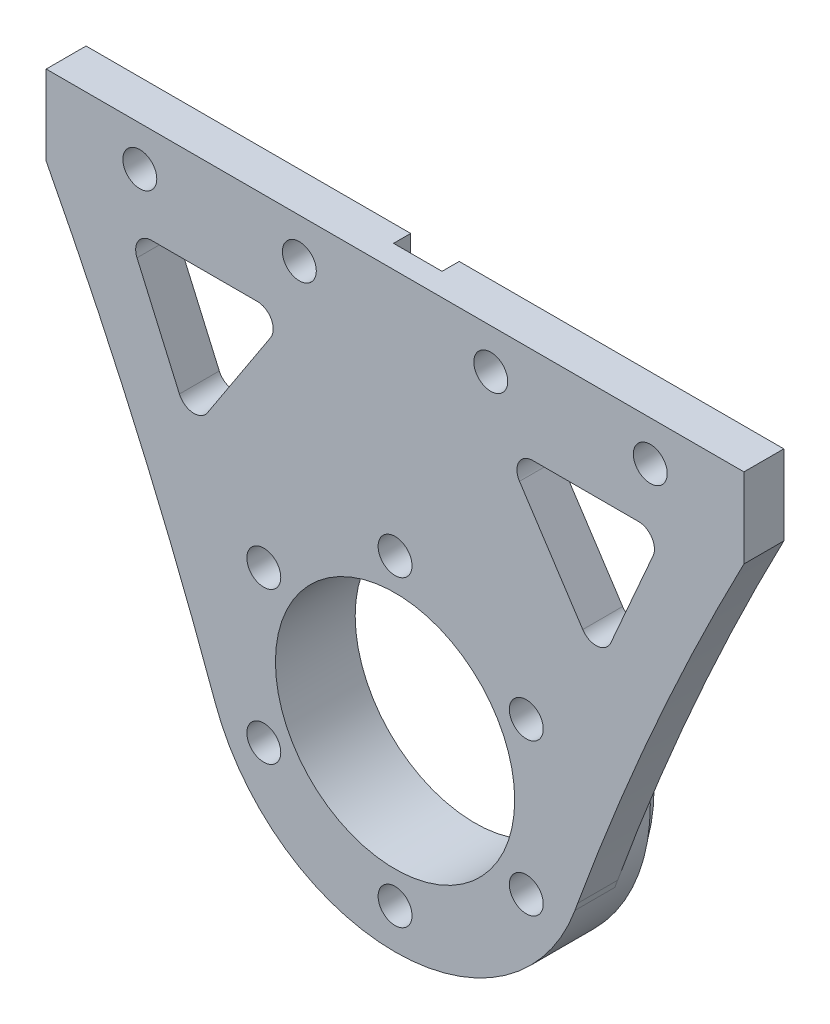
ISO-10303-21;
HEADER;
FILE_DESCRIPTION(('STEP AP214'),'2;1');
FILE_NAME('part.step','',(''),(''),'','','');
FILE_SCHEMA(('AUTOMOTIVE_DESIGN { 1 0 10303 214 1 1 1 1 }'));
ENDSEC;
DATA;
#1=APPLICATION_CONTEXT('core data for automotive mechanical design processes');
#2=APPLICATION_PROTOCOL_DEFINITION('international standard','automotive_design',2000,#1);
#3=PRODUCT_CONTEXT('',#1,'mechanical');
#4=PRODUCT('Part','Part','',(#3));
#5=PRODUCT_RELATED_PRODUCT_CATEGORY('part','',(#4));
#6=PRODUCT_DEFINITION_FORMATION('','',#4);
#7=PRODUCT_DEFINITION_CONTEXT('part definition',#1,'design');
#8=PRODUCT_DEFINITION('design','',#6,#7);
#9=PRODUCT_DEFINITION_SHAPE('','',#8);
#10=(LENGTH_UNIT() NAMED_UNIT(*) SI_UNIT(.MILLI.,.METRE.));
#11=(NAMED_UNIT(*) PLANE_ANGLE_UNIT() SI_UNIT($,.RADIAN.));
#12=(NAMED_UNIT(*) SI_UNIT($,.STERADIAN.) SOLID_ANGLE_UNIT());
#13=UNCERTAINTY_MEASURE_WITH_UNIT(LENGTH_MEASURE(1.E-05),#10,'distance_accuracy_value','');
#14=(GEOMETRIC_REPRESENTATION_CONTEXT(3) GLOBAL_UNCERTAINTY_ASSIGNED_CONTEXT((#13)) GLOBAL_UNIT_ASSIGNED_CONTEXT((#10,
#11,#12)) REPRESENTATION_CONTEXT('',''));
#15=CARTESIAN_POINT('',(0.,0.,0.));
#16=DIRECTION('',(0.,0.,1.));
#17=DIRECTION('',(1.,0.,0.));
#18=AXIS2_PLACEMENT_3D('',#15,#16,#17);
#19=CARTESIAN_POINT('',(1.94,46.,7.15));
#20=DIRECTION('',(0.,0.,-1.));
#21=DIRECTION('',(-1.,0.,0.));
#22=AXIS2_PLACEMENT_3D('',#19,#20,#21);
#23=CYLINDRICAL_SURFACE('',#22,1.1);
#24=CARTESIAN_POINT('',(1.94,46.,7.15));
#25=DIRECTION('',(0.,0.,-1.));
#26=DIRECTION('',(-1.,0.,0.));
#27=AXIS2_PLACEMENT_3D('',#24,#25,#26);
#28=CIRCLE('',#27,1.1);
#29=CARTESIAN_POINT('',(3.04,46.,7.15));
#30=VERTEX_POINT('',#29);
#31=CARTESIAN_POINT('',(0.84,46.,7.15));
#32=VERTEX_POINT('',#31);
#33=EDGE_CURVE('E26',#30,#32,#28,.T.);
#34=ORIENTED_EDGE('',*,*,#33,.F.);
#35=DIRECTION('',(0.,0.,-1.));
#36=VECTOR('',#35,1.);
#37=CARTESIAN_POINT('',(3.04,46.,7.15));
#38=LINE('',#37,#36);
#39=CARTESIAN_POINT('',(3.04,46.,5.));
#40=VERTEX_POINT('',#39);
#41=EDGE_CURVE('E512',#30,#40,#38,.T.);
#42=ORIENTED_EDGE('',*,*,#41,.T.);
#43=CARTESIAN_POINT('',(1.94,46.,5.));
#44=DIRECTION('',(0.,0.,-1.));
#45=DIRECTION('',(-1.,0.,0.));
#46=AXIS2_PLACEMENT_3D('',#43,#44,#45);
#47=CIRCLE('',#46,1.1);
#48=CARTESIAN_POINT('',(0.84,46.,5.));
#49=VERTEX_POINT('',#48);
#50=EDGE_CURVE('E393',#40,#49,#47,.T.);
#51=ORIENTED_EDGE('',*,*,#50,.T.);
#52=DIRECTION('',(0.,0.,-1.));
#53=VECTOR('',#52,1.);
#54=CARTESIAN_POINT('',(0.84,46.,7.15));
#55=LINE('',#54,#53);
#56=EDGE_CURVE('E530',#32,#49,#55,.T.);
#57=ORIENTED_EDGE('',*,*,#56,.F.);
#58=EDGE_LOOP('',(#34,#42,#51,#57));
#59=FACE_BOUND('',#58,.T.);
#60=ADVANCED_FACE('F17',(#59),#23,.F.);
#61=CARTESIAN_POINT('',(-1.94,46.,7.15));
#62=DIRECTION('',(0.,0.,-1.));
#63=DIRECTION('',(-1.,0.,0.));
#64=AXIS2_PLACEMENT_3D('',#61,#62,#63);
#65=CYLINDRICAL_SURFACE('',#64,1.1);
#66=CARTESIAN_POINT('',(-1.94,46.,7.15));
#67=DIRECTION('',(0.,0.,-1.));
#68=DIRECTION('',(-1.,0.,0.));
#69=AXIS2_PLACEMENT_3D('',#66,#67,#68);
#70=CIRCLE('',#69,1.1);
#71=CARTESIAN_POINT('',(-0.84,46.,7.15));
#72=VERTEX_POINT('',#71);
#73=CARTESIAN_POINT('',(-3.04,46.,7.15));
#74=VERTEX_POINT('',#73);
#75=EDGE_CURVE('E11',#72,#74,#70,.T.);
#76=ORIENTED_EDGE('',*,*,#75,.F.);
#77=DIRECTION('',(0.,0.,1.));
#78=VECTOR('',#77,1.);
#79=CARTESIAN_POINT('',(-0.84,46.,7.15));
#80=LINE('',#79,#78);
#81=CARTESIAN_POINT('',(-0.84,46.,5.));
#82=VERTEX_POINT('',#81);
#83=EDGE_CURVE('E534',#82,#72,#80,.T.);
#84=ORIENTED_EDGE('',*,*,#83,.F.);
#85=CARTESIAN_POINT('',(-1.94,46.,5.));
#86=DIRECTION('',(0.,0.,-1.));
#87=DIRECTION('',(-1.,0.,0.));
#88=AXIS2_PLACEMENT_3D('',#85,#86,#87);
#89=CIRCLE('',#88,1.1);
#90=CARTESIAN_POINT('',(-3.04,46.,5.));
#91=VERTEX_POINT('',#90);
#92=EDGE_CURVE('E420',#82,#91,#89,.T.);
#93=ORIENTED_EDGE('',*,*,#92,.T.);
#94=DIRECTION('',(0.,0.,-1.));
#95=VECTOR('',#94,1.);
#96=CARTESIAN_POINT('',(-3.04,46.,7.15));
#97=LINE('',#96,#95);
#98=EDGE_CURVE('E522',#74,#91,#97,.T.);
#99=ORIENTED_EDGE('',*,*,#98,.F.);
#100=EDGE_LOOP('',(#76,#84,#93,#99));
#101=FACE_BOUND('',#100,.T.);
#102=ADVANCED_FACE('F550',(#101),#65,.F.);
#103=CARTESIAN_POINT('',(0.,0.,7.15));
#104=DIRECTION('',(0.,0.,-1.));
#105=DIRECTION('',(0.,-1.,0.));
#106=AXIS2_PLACEMENT_3D('',#103,#104,#105);
#107=PLANE('',#106);
#108=DIRECTION('',(0.,-1.,0.));
#109=VECTOR('',#108,1.);
#110=CARTESIAN_POINT('',(3.04,0.,7.15));
#111=LINE('',#110,#109);
#112=CARTESIAN_POINT('',(3.04,50.,7.15));
#113=VERTEX_POINT('',#112);
#114=EDGE_CURVE('E515',#113,#30,#111,.T.);
#115=ORIENTED_EDGE('',*,*,#114,.T.);
#116=ORIENTED_EDGE('',*,*,#33,.T.);
#117=DIRECTION('',(-1.,0.,0.));
#118=VECTOR('',#117,1.);
#119=CARTESIAN_POINT('',(0.,46.,7.15));
#120=LINE('',#119,#118);
#121=EDGE_CURVE('E526',#32,#72,#120,.T.);
#122=ORIENTED_EDGE('',*,*,#121,.T.);
#123=ORIENTED_EDGE('',*,*,#75,.T.);
#124=DIRECTION('',(0.,-1.,0.));
#125=VECTOR('',#124,1.);
#126=CARTESIAN_POINT('',(-3.04,0.,7.15));
#127=LINE('',#126,#125);
#128=CARTESIAN_POINT('',(-3.04,50.,7.15));
#129=VERTEX_POINT('',#128);
#130=EDGE_CURVE('E518',#129,#74,#127,.T.);
#131=ORIENTED_EDGE('',*,*,#130,.F.);
#132=DIRECTION('',(1.,0.,0.));
#133=VECTOR('',#132,1.);
#134=CARTESIAN_POINT('',(0.,50.,7.15));
#135=LINE('',#134,#133);
#136=EDGE_CURVE('E369',#129,#113,#135,.T.);
#137=ORIENTED_EDGE('',*,*,#136,.T.);
#138=EDGE_LOOP('',(#115,#116,#122,#123,#131,#137));
#139=FACE_BOUND('',#138,.T.);
#140=ADVANCED_FACE('F540',(#139),#107,.T.);
#141=CARTESIAN_POINT('',(0.,46.,7.15));
#142=DIRECTION('',(0.,-1.,0.));
#143=DIRECTION('',(0.,0.,-1.));
#144=AXIS2_PLACEMENT_3D('',#141,#142,#143);
#145=PLANE('',#144);
#146=ORIENTED_EDGE('',*,*,#121,.F.);
#147=ORIENTED_EDGE('',*,*,#56,.T.);
#148=DIRECTION('',(-1.,0.,0.));
#149=VECTOR('',#148,1.);
#150=CARTESIAN_POINT('',(0.,46.,5.));
#151=LINE('',#150,#149);
#152=EDGE_CURVE('E389',#49,#82,#151,.T.);
#153=ORIENTED_EDGE('',*,*,#152,.T.);
#154=ORIENTED_EDGE('',*,*,#83,.T.);
#155=EDGE_LOOP('',(#146,#147,#153,#154));
#156=FACE_BOUND('',#155,.T.);
#157=ADVANCED_FACE('F548',(#156),#145,.F.);
#158=CARTESIAN_POINT('',(-3.04,0.,7.15));
#159=DIRECTION('',(1.,0.,0.));
#160=DIRECTION('',(0.,-1.,0.));
#161=AXIS2_PLACEMENT_3D('',#158,#159,#160);
#162=PLANE('',#161);
#163=DIRECTION('',(0.,-1.,0.));
#164=VECTOR('',#163,1.);
#165=CARTESIAN_POINT('',(-3.04,0.,5.));
#166=LINE('',#165,#164);
#167=CARTESIAN_POINT('',(-3.04,50.,5.));
#168=VERTEX_POINT('',#167);
#169=EDGE_CURVE('E416',#168,#91,#166,.T.);
#170=ORIENTED_EDGE('',*,*,#169,.F.);
#171=DIRECTION('',(0.,0.,-1.));
#172=VECTOR('',#171,1.);
#173=CARTESIAN_POINT('',(-3.04,50.,7.15));
#174=LINE('',#173,#172);
#175=EDGE_CURVE('E373',#129,#168,#174,.T.);
#176=ORIENTED_EDGE('',*,*,#175,.F.);
#177=ORIENTED_EDGE('',*,*,#130,.T.);
#178=ORIENTED_EDGE('',*,*,#98,.T.);
#179=EDGE_LOOP('',(#170,#176,#177,#178));
#180=FACE_BOUND('',#179,.T.);
#181=ADVANCED_FACE('F560',(#180),#162,.T.);
#182=CARTESIAN_POINT('',(3.04,0.,7.15));
#183=DIRECTION('',(1.,0.,0.));
#184=DIRECTION('',(0.,-1.,0.));
#185=AXIS2_PLACEMENT_3D('',#182,#183,#184);
#186=PLANE('',#185);
#187=DIRECTION('',(0.,-1.,0.));
#188=VECTOR('',#187,1.);
#189=CARTESIAN_POINT('',(3.04,0.,5.));
#190=LINE('',#189,#188);
#191=CARTESIAN_POINT('',(3.04,50.,5.));
#192=VERTEX_POINT('',#191);
#193=EDGE_CURVE('E585',#192,#40,#190,.T.);
#194=ORIENTED_EDGE('',*,*,#193,.T.);
#195=ORIENTED_EDGE('',*,*,#41,.F.);
#196=ORIENTED_EDGE('',*,*,#114,.F.);
#197=DIRECTION('',(0.,0.,-1.));
#198=VECTOR('',#197,1.);
#199=CARTESIAN_POINT('',(3.04,50.,7.15));
#200=LINE('',#199,#198);
#201=EDGE_CURVE('E368',#113,#192,#200,.T.);
#202=ORIENTED_EDGE('',*,*,#201,.T.);
#203=EDGE_LOOP('',(#194,#195,#196,#202));
#204=FACE_BOUND('',#203,.T.);
#205=ADVANCED_FACE('F884',(#204),#186,.F.);
#206=CARTESIAN_POINT('',(0.,0.,0.));
#207=DIRECTION('',(0.,0.,1.));
#208=DIRECTION('',(1.,0.,0.));
#209=AXIS2_PLACEMENT_3D('',#206,#207,#208);
#210=PLANE('',#209);
#211=CARTESIAN_POINT('',(0.,0.,0.));
#212=DIRECTION('',(0.,0.,-1.));
#213=DIRECTION('',(-1.,0.,0.));
#214=AXIS2_PLACEMENT_3D('',#211,#212,#213);
#215=CIRCLE('',#214,15.);
#216=CARTESIAN_POINT('',(-15.,0.,0.));
#217=VERTEX_POINT('',#216);
#218=EDGE_CURVE('E608',#217,#217,#215,.T.);
#219=ORIENTED_EDGE('',*,*,#218,.F.);
#220=EDGE_LOOP('',(#219));
#221=FACE_BOUND('',#220,.T.);
#222=CARTESIAN_POINT('',(-1.32676290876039E-13,-19.,0.));
#223=DIRECTION('',(0.,0.,1.));
#224=DIRECTION('',(1.,0.,0.));
#225=AXIS2_PLACEMENT_3D('',#222,#223,#224);
#226=CIRCLE('',#225,2.125);
#227=CARTESIAN_POINT('',(2.12499999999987,-19.,0.));
#228=VERTEX_POINT('',#227);
#229=EDGE_CURVE('E590',#228,#228,#226,.T.);
#230=ORIENTED_EDGE('',*,*,#229,.T.);
#231=EDGE_LOOP('',(#230));
#232=FACE_BOUND('',#231,.T.);
#233=CARTESIAN_POINT('',(16.4544826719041,-9.50000000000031,0.));
#234=DIRECTION('',(0.,0.,1.));
#235=DIRECTION('',(1.,0.,0.));
#236=AXIS2_PLACEMENT_3D('',#233,#234,#235);
#237=CIRCLE('',#236,2.125);
#238=CARTESIAN_POINT('',(18.5794826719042,-9.50000000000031,0.));
#239=VERTEX_POINT('',#238);
#240=EDGE_CURVE('E591',#239,#239,#237,.T.);
#241=ORIENTED_EDGE('',*,*,#240,.T.);
#242=EDGE_LOOP('',(#241));
#243=FACE_BOUND('',#242,.T.);
#244=CARTESIAN_POINT('',(16.4544826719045,9.49999999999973,0.));
#245=DIRECTION('',(0.,0.,1.));
#246=DIRECTION('',(1.,0.,0.));
#247=AXIS2_PLACEMENT_3D('',#244,#245,#246);
#248=CIRCLE('',#247,2.125);
#249=CARTESIAN_POINT('',(18.5794826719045,9.49999999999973,0.));
#250=VERTEX_POINT('',#249);
#251=EDGE_CURVE('E764',#250,#250,#248,.T.);
#252=ORIENTED_EDGE('',*,*,#251,.T.);
#253=EDGE_LOOP('',(#252));
#254=FACE_BOUND('',#253,.T.);
#255=CARTESIAN_POINT('',(-16.4544826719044,-9.49999999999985,0.));
#256=DIRECTION('',(0.,0.,1.));
#257=DIRECTION('',(1.,0.,0.));
#258=AXIS2_PLACEMENT_3D('',#255,#256,#257);
#259=CIRCLE('',#258,2.125);
#260=CARTESIAN_POINT('',(-14.3294826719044,-9.49999999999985,0.));
#261=VERTEX_POINT('',#260);
#262=EDGE_CURVE('E841',#261,#261,#259,.T.);
#263=ORIENTED_EDGE('',*,*,#262,.T.);
#264=EDGE_LOOP('',(#263));
#265=FACE_BOUND('',#264,.T.);
#266=CARTESIAN_POINT('',(-16.4544826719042,9.50000000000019,0.));
#267=DIRECTION('',(0.,0.,1.));
#268=DIRECTION('',(1.,0.,0.));
#269=AXIS2_PLACEMENT_3D('',#266,#267,#268);
#270=CIRCLE('',#269,2.125);
#271=CARTESIAN_POINT('',(-14.3294826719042,9.50000000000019,0.));
#272=VERTEX_POINT('',#271);
#273=EDGE_CURVE('E835',#272,#272,#270,.T.);
#274=ORIENTED_EDGE('',*,*,#273,.T.);
#275=EDGE_LOOP('',(#274));
#276=FACE_BOUND('',#275,.T.);
#277=CARTESIAN_POINT('',(0.,19.,0.));
#278=DIRECTION('',(0.,0.,1.));
#279=DIRECTION('',(1.,0.,0.));
#280=AXIS2_PLACEMENT_3D('',#277,#278,#279);
#281=CIRCLE('',#280,2.125);
#282=CARTESIAN_POINT('',(2.125,19.,0.));
#283=VERTEX_POINT('',#282);
#284=EDGE_CURVE('E1424',#283,#283,#281,.T.);
#285=ORIENTED_EDGE('',*,*,#284,.T.);
#286=EDGE_LOOP('',(#285));
#287=FACE_BOUND('',#286,.T.);
#288=CARTESIAN_POINT('',(0.,0.,0.));
#289=DIRECTION('',(0.,0.,-1.));
#290=DIRECTION('',(-1.,0.,0.));
#291=AXIS2_PLACEMENT_3D('',#288,#289,#290);
#292=CIRCLE('',#291,22.47);
#293=CARTESIAN_POINT('',(-22.47,0.,0.));
#294=VERTEX_POINT('',#293);
#295=EDGE_CURVE('E612',#294,#294,#292,.T.);
#296=ORIENTED_EDGE('',*,*,#295,.T.);
#297=EDGE_LOOP('',(#296));
#298=FACE_BOUND('',#297,.T.);
#299=ADVANCED_FACE('F887',(#221,#232,#243,#254,#265,#276,#287,#298),#210,.F.);
#300=CARTESIAN_POINT('',(2.75504332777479,36.,0.));
#301=DIRECTION('',(0.,0.,1.));
#302=DIRECTION('',(1.,0.,0.));
#303=AXIS2_PLACEMENT_3D('',#300,#301,#302);
#304=CYLINDRICAL_SURFACE('',#303,2.);
#305=CARTESIAN_POINT('',(2.75504332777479,36.,5.));
#306=DIRECTION('',(0.,0.,1.));
#307=DIRECTION('',(1.,0.,0.));
#308=AXIS2_PLACEMENT_3D('',#305,#306,#307);
#309=CIRCLE('',#308,2.);
#310=CARTESIAN_POINT('',(4.42924497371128,37.0940972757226,5.));
#311=VERTEX_POINT('',#310);
#312=CARTESIAN_POINT('',(2.75504332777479,38.,5.));
#313=VERTEX_POINT('',#312);
#314=EDGE_CURVE('E406',#311,#313,#309,.T.);
#315=ORIENTED_EDGE('',*,*,#314,.F.);
#316=DIRECTION('',(0.,0.,-1.));
#317=VECTOR('',#316,1.);
#318=CARTESIAN_POINT('',(4.42924497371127,37.0940972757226,0.));
#319=LINE('',#318,#317);
#320=CARTESIAN_POINT('',(4.42924497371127,37.0940972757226,8.));
#321=VERTEX_POINT('',#320);
#322=EDGE_CURVE('E442',#321,#311,#319,.T.);
#323=ORIENTED_EDGE('',*,*,#322,.F.);
#324=CARTESIAN_POINT('',(2.75504332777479,36.,8.));
#325=DIRECTION('',(0.,0.,-1.));
#326=DIRECTION('',(-1.,0.,0.));
#327=AXIS2_PLACEMENT_3D('',#324,#325,#326);
#328=CIRCLE('',#327,2.);
#329=CARTESIAN_POINT('',(2.75504332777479,38.,8.));
#330=VERTEX_POINT('',#329);
#331=EDGE_CURVE('E73',#330,#321,#328,.T.);
#332=ORIENTED_EDGE('',*,*,#331,.F.);
#333=DIRECTION('',(0.,0.,1.));
#334=VECTOR('',#333,1.);
#335=CARTESIAN_POINT('',(2.75504332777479,38.,0.));
#336=LINE('',#335,#334);
#337=EDGE_CURVE('E501',#313,#330,#336,.T.);
#338=ORIENTED_EDGE('',*,*,#337,.F.);
#339=EDGE_LOOP('',(#315,#323,#332,#338));
#340=FACE_BOUND('',#339,.T.);
#341=ADVANCED_FACE('F888',(#340),#304,.F.);
#342=CARTESIAN_POINT('',(10.8360898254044,23.6342792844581,10.));
#343=DIRECTION('',(0.,0.,-1.));
#344=DIRECTION('',(-1.,0.,0.));
#345=AXIS2_PLACEMENT_3D('',#342,#343,#344);
#346=CYLINDRICAL_SURFACE('',#345,2.);
#347=CARTESIAN_POINT('',(10.8360898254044,23.6342792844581,5.));
#348=DIRECTION('',(0.,0.,1.));
#349=DIRECTION('',(1.,0.,0.));
#350=AXIS2_PLACEMENT_3D('',#347,#348,#349);
#351=CIRCLE('',#350,2.);
#352=CARTESIAN_POINT('',(10.0025444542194,21.8162578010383,5.));
#353=VERTEX_POINT('',#352);
#354=CARTESIAN_POINT('',(12.5102914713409,24.7283765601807,5.));
#355=VERTEX_POINT('',#354);
#356=EDGE_CURVE('E397',#353,#355,#351,.T.);
#357=ORIENTED_EDGE('',*,*,#356,.F.);
#358=DIRECTION('',(0.,0.,-1.));
#359=VECTOR('',#358,1.);
#360=CARTESIAN_POINT('',(10.0025444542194,21.8162578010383,10.));
#361=LINE('',#360,#359);
#362=CARTESIAN_POINT('',(10.0025444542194,21.8162578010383,8.));
#363=VERTEX_POINT('',#362);
#364=EDGE_CURVE('E636',#363,#353,#361,.T.);
#365=ORIENTED_EDGE('',*,*,#364,.F.);
#366=CARTESIAN_POINT('',(10.8360898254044,23.6342792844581,8.));
#367=DIRECTION('',(0.,0.,-1.));
#368=DIRECTION('',(-1.,0.,0.));
#369=AXIS2_PLACEMENT_3D('',#366,#367,#368);
#370=CIRCLE('',#369,2.);
#371=CARTESIAN_POINT('',(12.5102914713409,24.7283765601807,8.));
#372=VERTEX_POINT('',#371);
#373=EDGE_CURVE('E509',#372,#363,#370,.T.);
#374=ORIENTED_EDGE('',*,*,#373,.F.);
#375=DIRECTION('',(0.,0.,1.));
#376=VECTOR('',#375,1.);
#377=CARTESIAN_POINT('',(12.5102914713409,24.7283765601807,8.));
#378=LINE('',#377,#376);
#379=EDGE_CURVE('E484',#355,#372,#378,.T.);
#380=ORIENTED_EDGE('',*,*,#379,.F.);
#381=EDGE_LOOP('',(#357,#365,#374,#380));
#382=FACE_BOUND('',#381,.T.);
#383=ADVANCED_FACE('F891',(#382),#346,.F.);
#384=CARTESIAN_POINT('',(-2.75504332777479,36.,0.));
#385=DIRECTION('',(0.,0.,-1.));
#386=DIRECTION('',(-1.,0.,0.));
#387=AXIS2_PLACEMENT_3D('',#384,#385,#386);
#388=CYLINDRICAL_SURFACE('',#387,2.);
#389=CARTESIAN_POINT('',(-2.75504332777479,36.,5.));
#390=DIRECTION('',(0.,0.,1.));
#391=DIRECTION('',(1.,0.,0.));
#392=AXIS2_PLACEMENT_3D('',#389,#390,#391);
#393=CIRCLE('',#392,2.);
#394=CARTESIAN_POINT('',(-2.75504332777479,38.,5.));
#395=VERTEX_POINT('',#394);
#396=CARTESIAN_POINT('',(-4.42924497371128,37.0940972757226,5.));
#397=VERTEX_POINT('',#396);
#398=EDGE_CURVE('E630',#395,#397,#393,.T.);
#399=ORIENTED_EDGE('',*,*,#398,.F.);
#400=DIRECTION('',(0.,0.,-1.));
#401=VECTOR('',#400,1.);
#402=CARTESIAN_POINT('',(-2.75504332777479,38.,5.));
#403=LINE('',#402,#401);
#404=CARTESIAN_POINT('',(-2.75504332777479,38.,8.));
#405=VERTEX_POINT('',#404);
#406=EDGE_CURVE('E498',#405,#395,#403,.T.);
#407=ORIENTED_EDGE('',*,*,#406,.F.);
#408=CARTESIAN_POINT('',(-2.75504332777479,36.,8.));
#409=DIRECTION('',(0.,0.,-1.));
#410=DIRECTION('',(-1.,0.,0.));
#411=AXIS2_PLACEMENT_3D('',#408,#409,#410);
#412=CIRCLE('',#411,2.);
#413=CARTESIAN_POINT('',(-4.42924497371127,37.0940972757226,8.));
#414=VERTEX_POINT('',#413);
#415=EDGE_CURVE('E504',#414,#405,#412,.T.);
#416=ORIENTED_EDGE('',*,*,#415,.F.);
#417=DIRECTION('',(0.,0.,1.));
#418=VECTOR('',#417,1.);
#419=CARTESIAN_POINT('',(-4.42924497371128,37.0940972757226,8.));
#420=LINE('',#419,#418);
#421=EDGE_CURVE('E437',#397,#414,#420,.T.);
#422=ORIENTED_EDGE('',*,*,#421,.F.);
#423=EDGE_LOOP('',(#399,#407,#416,#422));
#424=FACE_BOUND('',#423,.T.);
#425=ADVANCED_FACE('F892',(#424),#388,.F.);
#426=CARTESIAN_POINT('',(0.,0.,8.));
#427=DIRECTION('',(0.,0.,-1.));
#428=DIRECTION('',(0.,-1.,0.));
#429=AXIS2_PLACEMENT_3D('',#426,#427,#428);
#430=PLANE('',#429);
#431=DIRECTION('',(0.547048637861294,0.837100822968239,0.));
#432=VECTOR('',#431,1.);
#433=CARTESIAN_POINT('',(-20.0904197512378,13.129167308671,8.));
#434=LINE('',#433,#432);
#435=CARTESIAN_POINT('',(-12.5102914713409,24.7283765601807,8.));
#436=VERTEX_POINT('',#435);
#437=EDGE_CURVE('E441',#436,#414,#434,.T.);
#438=ORIENTED_EDGE('',*,*,#437,.T.);
#439=ORIENTED_EDGE('',*,*,#415,.T.);
#440=DIRECTION('',(1.,0.,0.));
#441=VECTOR('',#440,1.);
#442=CARTESIAN_POINT('',(0.,38.,8.));
#443=LINE('',#442,#441);
#444=EDGE_CURVE('E497',#405,#330,#443,.T.);
#445=ORIENTED_EDGE('',*,*,#444,.T.);
#446=ORIENTED_EDGE('',*,*,#331,.T.);
#447=DIRECTION('',(-0.547048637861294,0.837100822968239,0.));
#448=VECTOR('',#447,1.);
#449=CARTESIAN_POINT('',(20.0904197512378,13.129167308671,8.));
#450=LINE('',#449,#448);
#451=EDGE_CURVE('E488',#372,#321,#450,.T.);
#452=ORIENTED_EDGE('',*,*,#451,.F.);
#453=ORIENTED_EDGE('',*,*,#373,.T.);
#454=CARTESIAN_POINT('',(0.,0.,8.));
#455=DIRECTION('',(0.,0.,1.));
#456=DIRECTION('',(-1.,0.,0.));
#457=AXIS2_PLACEMENT_3D('',#454,#455,#456);
#458=CIRCLE('',#457,24.);
#459=CARTESIAN_POINT('',(-10.0025444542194,21.8162578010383,8.));
#460=VERTEX_POINT('',#459);
#461=EDGE_CURVE('E641',#363,#460,#458,.T.);
#462=ORIENTED_EDGE('',*,*,#461,.T.);
#463=CARTESIAN_POINT('',(-10.8360898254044,23.6342792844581,8.));
#464=DIRECTION('',(0.,0.,-1.));
#465=DIRECTION('',(-1.,0.,0.));
#466=AXIS2_PLACEMENT_3D('',#463,#464,#465);
#467=CIRCLE('',#466,2.);
#468=EDGE_CURVE('E631',#460,#436,#467,.T.);
#469=ORIENTED_EDGE('',*,*,#468,.T.);
#470=EDGE_LOOP('',(#438,#439,#445,#446,#452,#453,#462,#469));
#471=FACE_BOUND('',#470,.T.);
#472=ADVANCED_FACE('F895',(#471),#430,.T.);
#473=CARTESIAN_POINT('',(0.,38.,0.));
#474=DIRECTION('',(0.,-1.,0.));
#475=DIRECTION('',(0.,0.,-1.));
#476=AXIS2_PLACEMENT_3D('',#473,#474,#475);
#477=PLANE('',#476);
#478=ORIENTED_EDGE('',*,*,#444,.F.);
#479=ORIENTED_EDGE('',*,*,#406,.T.);
#480=DIRECTION('',(1.,0.,0.));
#481=VECTOR('',#480,1.);
#482=CARTESIAN_POINT('',(0.,38.,5.));
#483=LINE('',#482,#481);
#484=EDGE_CURVE('E723',#395,#313,#483,.T.);
#485=ORIENTED_EDGE('',*,*,#484,.T.);
#486=ORIENTED_EDGE('',*,*,#337,.T.);
#487=EDGE_LOOP('',(#478,#479,#485,#486));
#488=FACE_BOUND('',#487,.T.);
#489=ADVANCED_FACE('F899',(#488),#477,.T.);
#490=CARTESIAN_POINT('',(-20.0904197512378,13.129167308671,0.));
#491=DIRECTION('',(0.837100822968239,-0.547048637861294,0.));
#492=DIRECTION('',(0.,0.,-1.));
#493=AXIS2_PLACEMENT_3D('',#490,#491,#492);
#494=PLANE('',#493);
#495=DIRECTION('',(0.547048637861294,0.837100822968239,0.));
#496=VECTOR('',#495,1.);
#497=CARTESIAN_POINT('',(-20.0904197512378,13.129167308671,5.));
#498=LINE('',#497,#496);
#499=CARTESIAN_POINT('',(-12.5102914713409,24.7283765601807,5.));
#500=VERTEX_POINT('',#499);
#501=EDGE_CURVE('E412',#500,#397,#498,.T.);
#502=ORIENTED_EDGE('',*,*,#501,.T.);
#503=ORIENTED_EDGE('',*,*,#421,.T.);
#504=ORIENTED_EDGE('',*,*,#437,.F.);
#505=DIRECTION('',(0.,0.,-1.));
#506=VECTOR('',#505,1.);
#507=CARTESIAN_POINT('',(-12.5102914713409,24.7283765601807,0.));
#508=LINE('',#507,#506);
#509=EDGE_CURVE('E647',#436,#500,#508,.T.);
#510=ORIENTED_EDGE('',*,*,#509,.T.);
#511=EDGE_LOOP('',(#502,#503,#504,#510));
#512=FACE_BOUND('',#511,.T.);
#513=ADVANCED_FACE('F903',(#512),#494,.T.);
#514=CARTESIAN_POINT('',(20.0904197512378,13.129167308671,0.));
#515=DIRECTION('',(0.837100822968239,0.547048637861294,0.));
#516=DIRECTION('',(0.,0.,-1.));
#517=AXIS2_PLACEMENT_3D('',#514,#515,#516);
#518=PLANE('',#517);
#519=DIRECTION('',(-0.547048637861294,0.837100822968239,0.));
#520=VECTOR('',#519,1.);
#521=CARTESIAN_POINT('',(20.0904197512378,13.129167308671,5.));
#522=LINE('',#521,#520);
#523=EDGE_CURVE('E402',#355,#311,#522,.T.);
#524=ORIENTED_EDGE('',*,*,#523,.F.);
#525=ORIENTED_EDGE('',*,*,#379,.T.);
#526=ORIENTED_EDGE('',*,*,#451,.T.);
#527=ORIENTED_EDGE('',*,*,#322,.T.);
#528=EDGE_LOOP('',(#524,#525,#526,#527));
#529=FACE_BOUND('',#528,.T.);
#530=ADVANCED_FACE('F910',(#529),#518,.F.);
#531=CARTESIAN_POINT('',(25.2039590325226,23.8707999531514,35.));
#532=DIRECTION('',(0.,0.,1.));
#533=DIRECTION('',(1.,0.,0.));
#534=AXIS2_PLACEMENT_3D('',#531,#532,#533);
#535=CYLINDRICAL_SURFACE('',#534,2.);
#536=CARTESIAN_POINT('',(25.2039590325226,23.8707999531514,10.));
#537=DIRECTION('',(0.,0.,-1.));
#538=DIRECTION('',(1.,0.,0.));
#539=AXIS2_PLACEMENT_3D('',#536,#537,#538);
#540=CIRCLE('',#539,2.);
#541=CARTESIAN_POINT('',(27.0356984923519,23.067848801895,10.));
#542=VERTEX_POINT('',#541);
#543=CARTESIAN_POINT('',(23.529757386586,22.7767026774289,10.));
#544=VERTEX_POINT('',#543);
#545=EDGE_CURVE('E342',#542,#544,#540,.T.);
#546=ORIENTED_EDGE('',*,*,#545,.F.);
#547=DIRECTION('',(0.,0.,1.));
#548=VECTOR('',#547,1.);
#549=CARTESIAN_POINT('',(27.0356984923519,23.067848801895,10.));
#550=LINE('',#549,#548);
#551=CARTESIAN_POINT('',(27.0356984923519,23.067848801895,5.));
#552=VERTEX_POINT('',#551);
#553=EDGE_CURVE('E317',#552,#542,#550,.T.);
#554=ORIENTED_EDGE('',*,*,#553,.F.);
#555=CARTESIAN_POINT('',(25.2039590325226,23.8707999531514,5.));
#556=DIRECTION('',(0.,0.,1.));
#557=DIRECTION('',(1.,0.,0.));
#558=AXIS2_PLACEMENT_3D('',#555,#556,#557);
#559=CIRCLE('',#558,2.);
#560=CARTESIAN_POINT('',(23.529757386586,22.7767026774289,5.));
#561=VERTEX_POINT('',#560);
#562=EDGE_CURVE('E428',#561,#552,#559,.T.);
#563=ORIENTED_EDGE('',*,*,#562,.F.);
#564=DIRECTION('',(0.,0.,-1.));
#565=VECTOR('',#564,1.);
#566=CARTESIAN_POINT('',(23.529757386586,22.7767026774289,5.));
#567=LINE('',#566,#565);
#568=EDGE_CURVE('E483',#544,#561,#567,.T.);
#569=ORIENTED_EDGE('',*,*,#568,.F.);
#570=EDGE_LOOP('',(#546,#554,#563,#569));
#571=FACE_BOUND('',#570,.T.);
#572=ADVANCED_FACE('F914',(#571),#535,.F.);
#573=CARTESIAN_POINT('',(17.2774797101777,36.,35.));
#574=DIRECTION('',(0.,0.,1.));
#575=DIRECTION('',(1.,0.,0.));
#576=AXIS2_PLACEMENT_3D('',#573,#574,#575);
#577=CYLINDRICAL_SURFACE('',#576,2.);
#578=CARTESIAN_POINT('',(17.2774797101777,36.,10.));
#579=DIRECTION('',(0.,0.,-1.));
#580=DIRECTION('',(1.,0.,0.));
#581=AXIS2_PLACEMENT_3D('',#578,#579,#580);
#582=CIRCLE('',#581,2.);
#583=CARTESIAN_POINT('',(15.6032780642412,34.9059027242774,10.));
#584=VERTEX_POINT('',#583);
#585=CARTESIAN_POINT('',(17.2774797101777,38.,10.));
#586=VERTEX_POINT('',#585);
#587=EDGE_CURVE('E309',#584,#586,#582,.T.);
#588=ORIENTED_EDGE('',*,*,#587,.F.);
#589=DIRECTION('',(0.,0.,1.));
#590=VECTOR('',#589,1.);
#591=CARTESIAN_POINT('',(15.6032780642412,34.9059027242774,10.));
#592=LINE('',#591,#590);
#593=CARTESIAN_POINT('',(15.6032780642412,34.9059027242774,5.));
#594=VERTEX_POINT('',#593);
#595=EDGE_CURVE('E316',#594,#584,#592,.T.);
#596=ORIENTED_EDGE('',*,*,#595,.F.);
#597=CARTESIAN_POINT('',(17.2774797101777,36.,5.));
#598=DIRECTION('',(0.,0.,1.));
#599=DIRECTION('',(1.,0.,0.));
#600=AXIS2_PLACEMENT_3D('',#597,#598,#599);
#601=CIRCLE('',#600,2.);
#602=CARTESIAN_POINT('',(17.2774797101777,38.,5.));
#603=VERTEX_POINT('',#602);
#604=EDGE_CURVE('E312',#603,#594,#601,.T.);
#605=ORIENTED_EDGE('',*,*,#604,.F.);
#606=DIRECTION('',(0.,0.,-1.));
#607=VECTOR('',#606,1.);
#608=CARTESIAN_POINT('',(17.2774797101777,38.,5.));
#609=LINE('',#608,#607);
#610=EDGE_CURVE('E305',#586,#603,#609,.T.);
#611=ORIENTED_EDGE('',*,*,#610,.F.);
#612=EDGE_LOOP('',(#588,#596,#605,#611));
#613=FACE_BOUND('',#612,.T.);
#614=ADVANCED_FACE('F307',(#613),#577,.F.);
#615=CARTESIAN_POINT('',(-25.2039590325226,23.8707999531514,35.));
#616=DIRECTION('',(0.,0.,1.));
#617=DIRECTION('',(1.,0.,0.));
#618=AXIS2_PLACEMENT_3D('',#615,#616,#617);
#619=CYLINDRICAL_SURFACE('',#618,2.);
#620=CARTESIAN_POINT('',(-25.2039590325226,23.8707999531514,10.));
#621=DIRECTION('',(0.,0.,-1.));
#622=DIRECTION('',(1.,0.,0.));
#623=AXIS2_PLACEMENT_3D('',#620,#621,#622);
#624=CIRCLE('',#623,2.);
#625=CARTESIAN_POINT('',(-23.529757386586,22.7767026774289,10.));
#626=VERTEX_POINT('',#625);
#627=CARTESIAN_POINT('',(-27.0356984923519,23.067848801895,10.));
#628=VERTEX_POINT('',#627);
#629=EDGE_CURVE('E349',#626,#628,#624,.T.);
#630=ORIENTED_EDGE('',*,*,#629,.F.);
#631=DIRECTION('',(0.,0.,1.));
#632=VECTOR('',#631,1.);
#633=CARTESIAN_POINT('',(-23.529757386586,22.7767026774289,10.));
#634=LINE('',#633,#632);
#635=CARTESIAN_POINT('',(-23.529757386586,22.7767026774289,5.));
#636=VERTEX_POINT('',#635);
#637=EDGE_CURVE('E471',#636,#626,#634,.T.);
#638=ORIENTED_EDGE('',*,*,#637,.F.);
#639=CARTESIAN_POINT('',(-25.2039590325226,23.8707999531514,5.));
#640=DIRECTION('',(0.,0.,1.));
#641=DIRECTION('',(1.,0.,0.));
#642=AXIS2_PLACEMENT_3D('',#639,#640,#641);
#643=CIRCLE('',#642,2.);
#644=CARTESIAN_POINT('',(-27.0356984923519,23.067848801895,5.));
#645=VERTEX_POINT('',#644);
#646=EDGE_CURVE('E449',#645,#636,#643,.T.);
#647=ORIENTED_EDGE('',*,*,#646,.F.);
#648=DIRECTION('',(0.,0.,-1.));
#649=VECTOR('',#648,1.);
#650=CARTESIAN_POINT('',(-27.0356984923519,23.067848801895,5.));
#651=LINE('',#650,#649);
#652=EDGE_CURVE('E617',#628,#645,#651,.T.);
#653=ORIENTED_EDGE('',*,*,#652,.F.);
#654=EDGE_LOOP('',(#630,#638,#647,#653));
#655=FACE_BOUND('',#654,.T.);
#656=ADVANCED_FACE('F920',(#655),#619,.F.);
#657=CARTESIAN_POINT('',(-30.5208478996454,36.,35.));
#658=DIRECTION('',(0.,0.,1.));
#659=DIRECTION('',(1.,0.,0.));
#660=AXIS2_PLACEMENT_3D('',#657,#658,#659);
#661=CYLINDRICAL_SURFACE('',#660,2.);
#662=CARTESIAN_POINT('',(-30.5208478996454,36.,10.));
#663=DIRECTION('',(0.,0.,-1.));
#664=DIRECTION('',(1.,0.,0.));
#665=AXIS2_PLACEMENT_3D('',#662,#663,#664);
#666=CIRCLE('',#665,2.);
#667=CARTESIAN_POINT('',(-32.3525873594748,35.1970488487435,10.));
#668=VERTEX_POINT('',#667);
#669=CARTESIAN_POINT('',(-30.5208478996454,38.,10.));
#670=VERTEX_POINT('',#669);
#671=EDGE_CURVE('E357',#668,#670,#666,.T.);
#672=ORIENTED_EDGE('',*,*,#671,.F.);
#673=DIRECTION('',(0.,0.,1.));
#674=VECTOR('',#673,1.);
#675=CARTESIAN_POINT('',(-32.3525873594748,35.1970488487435,10.));
#676=LINE('',#675,#674);
#677=CARTESIAN_POINT('',(-32.3525873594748,35.1970488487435,5.));
#678=VERTEX_POINT('',#677);
#679=EDGE_CURVE('E476',#678,#668,#676,.T.);
#680=ORIENTED_EDGE('',*,*,#679,.F.);
#681=CARTESIAN_POINT('',(-30.5208478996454,36.,5.));
#682=DIRECTION('',(0.,0.,1.));
#683=DIRECTION('',(1.,0.,0.));
#684=AXIS2_PLACEMENT_3D('',#681,#682,#683);
#685=CIRCLE('',#684,2.);
#686=CARTESIAN_POINT('',(-30.5208478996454,38.,5.));
#687=VERTEX_POINT('',#686);
#688=EDGE_CURVE('E460',#687,#678,#685,.T.);
#689=ORIENTED_EDGE('',*,*,#688,.F.);
#690=DIRECTION('',(0.,0.,-1.));
#691=VECTOR('',#690,1.);
#692=CARTESIAN_POINT('',(-30.5208478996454,38.,5.));
#693=LINE('',#692,#691);
#694=EDGE_CURVE('E239',#670,#687,#693,.T.);
#695=ORIENTED_EDGE('',*,*,#694,.F.);
#696=EDGE_LOOP('',(#672,#680,#689,#695));
#697=FACE_BOUND('',#696,.T.);
#698=ADVANCED_FACE('F924',(#697),#661,.F.);
#699=CARTESIAN_POINT('',(13.5812734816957,38.,35.));
#700=DIRECTION('',(-0.837100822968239,-0.547048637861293,0.));
#701=DIRECTION('',(-0.547048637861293,0.837100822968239,0.));
#702=AXIS2_PLACEMENT_3D('',#699,#700,#701);
#703=PLANE('',#702);
#704=DIRECTION('',(-0.547048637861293,0.837100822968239,0.));
#705=VECTOR('',#704,1.);
#706=CARTESIAN_POINT('',(13.5812734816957,38.,5.));
#707=LINE('',#706,#705);
#708=EDGE_CURVE('E424',#561,#594,#707,.T.);
#709=ORIENTED_EDGE('',*,*,#708,.T.);
#710=ORIENTED_EDGE('',*,*,#595,.T.);
#711=DIRECTION('',(0.547048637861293,-0.837100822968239,0.));
#712=VECTOR('',#711,1.);
#713=CARTESIAN_POINT('',(26.9184364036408,17.5913027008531,10.));
#714=LINE('',#713,#712);
#715=EDGE_CURVE('E335',#584,#544,#714,.T.);
#716=ORIENTED_EDGE('',*,*,#715,.T.);
#717=ORIENTED_EDGE('',*,*,#568,.T.);
#718=EDGE_LOOP('',(#709,#710,#716,#717));
#719=FACE_BOUND('',#718,.T.);
#720=ADVANCED_FACE('F928',(#719),#703,.F.);
#721=CARTESIAN_POINT('',(33.5812734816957,38.,35.));
#722=DIRECTION('',(0.,1.,0.));
#723=DIRECTION('',(1.,0.,0.));
#724=AXIS2_PLACEMENT_3D('',#721,#722,#723);
#725=PLANE('',#724);
#726=DIRECTION('',(1.,0.,0.));
#727=VECTOR('',#726,1.);
#728=CARTESIAN_POINT('',(33.5812734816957,38.,5.));
#729=LINE('',#728,#727);
#730=CARTESIAN_POINT('',(30.5208478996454,38.,5.));
#731=VERTEX_POINT('',#730);
#732=EDGE_CURVE('E436',#603,#731,#729,.T.);
#733=ORIENTED_EDGE('',*,*,#732,.T.);
#734=DIRECTION('',(0.,0.,1.));
#735=VECTOR('',#734,1.);
#736=CARTESIAN_POINT('',(30.5208478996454,38.,10.));
#737=LINE('',#736,#735);
#738=CARTESIAN_POINT('',(30.5208478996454,38.,10.));
#739=VERTEX_POINT('',#738);
#740=EDGE_CURVE('E323',#731,#739,#737,.T.);
#741=ORIENTED_EDGE('',*,*,#740,.T.);
#742=DIRECTION('',(-1.,0.,0.));
#743=VECTOR('',#742,1.);
#744=CARTESIAN_POINT('',(0.,38.,10.));
#745=LINE('',#744,#743);
#746=EDGE_CURVE('E320',#739,#586,#745,.T.);
#747=ORIENTED_EDGE('',*,*,#746,.T.);
#748=ORIENTED_EDGE('',*,*,#610,.T.);
#749=EDGE_LOOP('',(#733,#741,#747,#748));
#750=FACE_BOUND('',#749,.T.);
#751=ADVANCED_FACE('F321',(#750),#725,.F.);
#752=CARTESIAN_POINT('',(25.5517619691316,19.6826054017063,35.));
#753=DIRECTION('',(0.915869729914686,-0.401475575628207,0.));
#754=DIRECTION('',(0.,0.,-1.));
#755=AXIS2_PLACEMENT_3D('',#752,#753,#754);
#756=PLANE('',#755);
#757=DIRECTION('',(0.401475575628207,0.915869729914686,0.));
#758=VECTOR('',#757,1.);
#759=CARTESIAN_POINT('',(14.1959808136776,-6.2228714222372,10.));
#760=LINE('',#759,#758);
#761=CARTESIAN_POINT('',(32.3525873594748,35.1970488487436,10.));
#762=VERTEX_POINT('',#761);
#763=EDGE_CURVE('E620',#542,#762,#760,.T.);
#764=ORIENTED_EDGE('',*,*,#763,.T.);
#765=DIRECTION('',(0.,0.,-1.));
#766=VECTOR('',#765,1.);
#767=CARTESIAN_POINT('',(32.3525873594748,35.1970488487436,5.));
#768=LINE('',#767,#766);
#769=CARTESIAN_POINT('',(32.3525873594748,35.1970488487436,5.));
#770=VERTEX_POINT('',#769);
#771=EDGE_CURVE('E479',#762,#770,#768,.T.);
#772=ORIENTED_EDGE('',*,*,#771,.T.);
#773=DIRECTION('',(-0.401475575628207,-0.915869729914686,0.));
#774=VECTOR('',#773,1.);
#775=CARTESIAN_POINT('',(25.5517619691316,19.6826054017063,5.));
#776=LINE('',#775,#774);
#777=EDGE_CURVE('E432',#770,#552,#776,.T.);
#778=ORIENTED_EDGE('',*,*,#777,.T.);
#779=ORIENTED_EDGE('',*,*,#553,.T.);
#780=EDGE_LOOP('',(#764,#772,#778,#779));
#781=FACE_BOUND('',#780,.T.);
#782=ADVANCED_FACE('F935',(#781),#756,.F.);
#783=CARTESIAN_POINT('',(-25.5517619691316,19.6826054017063,35.));
#784=DIRECTION('',(-0.915869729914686,-0.401475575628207,0.));
#785=DIRECTION('',(-0.401475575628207,0.915869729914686,0.));
#786=AXIS2_PLACEMENT_3D('',#783,#784,#785);
#787=PLANE('',#786);
#788=DIRECTION('',(-0.401475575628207,0.915869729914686,0.));
#789=VECTOR('',#788,1.);
#790=CARTESIAN_POINT('',(-25.5517619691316,19.6826054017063,5.));
#791=LINE('',#790,#789);
#792=EDGE_CURVE('E445',#645,#678,#791,.T.);
#793=ORIENTED_EDGE('',*,*,#792,.T.);
#794=ORIENTED_EDGE('',*,*,#679,.T.);
#795=DIRECTION('',(0.401475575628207,-0.915869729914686,0.));
#796=VECTOR('',#795,1.);
#797=CARTESIAN_POINT('',(-14.1959808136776,-6.2228714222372,10.));
#798=LINE('',#797,#796);
#799=EDGE_CURVE('E353',#668,#628,#798,.T.);
#800=ORIENTED_EDGE('',*,*,#799,.T.);
#801=ORIENTED_EDGE('',*,*,#652,.T.);
#802=EDGE_LOOP('',(#793,#794,#800,#801));
#803=FACE_BOUND('',#802,.T.);
#804=ADVANCED_FACE('F938',(#803),#787,.F.);
#805=CARTESIAN_POINT('',(-33.5812734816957,38.,35.));
#806=DIRECTION('',(0.,1.,0.));
#807=DIRECTION('',(1.,0.,0.));
#808=AXIS2_PLACEMENT_3D('',#805,#806,#807);
#809=PLANE('',#808);
#810=DIRECTION('',(1.,0.,0.));
#811=VECTOR('',#810,1.);
#812=CARTESIAN_POINT('',(-33.5812734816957,38.,5.));
#813=LINE('',#812,#811);
#814=CARTESIAN_POINT('',(-17.2774797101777,38.,5.));
#815=VERTEX_POINT('',#814);
#816=EDGE_CURVE('E457',#687,#815,#813,.T.);
#817=ORIENTED_EDGE('',*,*,#816,.T.);
#818=DIRECTION('',(0.,0.,1.));
#819=VECTOR('',#818,1.);
#820=CARTESIAN_POINT('',(-17.2774797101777,38.,10.));
#821=LINE('',#820,#819);
#822=CARTESIAN_POINT('',(-17.2774797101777,38.,10.));
#823=VERTEX_POINT('',#822);
#824=EDGE_CURVE('E674',#815,#823,#821,.T.);
#825=ORIENTED_EDGE('',*,*,#824,.T.);
#826=DIRECTION('',(-1.,0.,0.));
#827=VECTOR('',#826,1.);
#828=CARTESIAN_POINT('',(0.,38.,10.));
#829=LINE('',#828,#827);
#830=EDGE_CURVE('E361',#823,#670,#829,.T.);
#831=ORIENTED_EDGE('',*,*,#830,.T.);
#832=ORIENTED_EDGE('',*,*,#694,.T.);
#833=EDGE_LOOP('',(#817,#825,#831,#832));
#834=FACE_BOUND('',#833,.T.);
#835=ADVANCED_FACE('F942',(#834),#809,.F.);
#836=CARTESIAN_POINT('',(-13.5812734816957,38.,35.));
#837=DIRECTION('',(0.837100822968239,-0.547048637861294,0.));
#838=DIRECTION('',(0.,0.,-1.));
#839=AXIS2_PLACEMENT_3D('',#836,#837,#838);
#840=PLANE('',#839);
#841=DIRECTION('',(0.547048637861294,0.837100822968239,0.));
#842=VECTOR('',#841,1.);
#843=CARTESIAN_POINT('',(-26.9184364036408,17.5913027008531,10.));
#844=LINE('',#843,#842);
#845=CARTESIAN_POINT('',(-15.6032780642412,34.9059027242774,10.));
#846=VERTEX_POINT('',#845);
#847=EDGE_CURVE('E328',#626,#846,#844,.T.);
#848=ORIENTED_EDGE('',*,*,#847,.T.);
#849=DIRECTION('',(0.,0.,-1.));
#850=VECTOR('',#849,1.);
#851=CARTESIAN_POINT('',(-15.6032780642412,34.9059027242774,5.));
#852=LINE('',#851,#850);
#853=CARTESIAN_POINT('',(-15.6032780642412,34.9059027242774,5.));
#854=VERTEX_POINT('',#853);
#855=EDGE_CURVE('E470',#846,#854,#852,.T.);
#856=ORIENTED_EDGE('',*,*,#855,.T.);
#857=DIRECTION('',(-0.547048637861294,-0.837100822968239,0.));
#858=VECTOR('',#857,1.);
#859=CARTESIAN_POINT('',(-13.5812734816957,38.,5.));
#860=LINE('',#859,#858);
#861=EDGE_CURVE('E453',#854,#636,#860,.T.);
#862=ORIENTED_EDGE('',*,*,#861,.T.);
#863=ORIENTED_EDGE('',*,*,#637,.T.);
#864=EDGE_LOOP('',(#848,#856,#862,#863));
#865=FACE_BOUND('',#864,.T.);
#866=ADVANCED_FACE('F947',(#865),#840,.F.);
#867=CARTESIAN_POINT('',(-389.37828023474,-140.646989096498,5.));
#868=DIRECTION('',(0.,0.,-1.));
#869=DIRECTION('',(-1.,0.,0.));
#870=AXIS2_PLACEMENT_3D('',#867,#868,#869);
#871=CYLINDRICAL_SURFACE('',#870,390.);
#872=CARTESIAN_POINT('',(-389.37828023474,-140.646989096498,5.));
#873=DIRECTION('',(0.,0.,1.));
#874=DIRECTION('',(1.,0.,0.));
#875=AXIS2_PLACEMENT_3D('',#872,#873,#874);
#876=CIRCLE('',#875,390.);
#877=CARTESIAN_POINT('',(-22.8981581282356,-7.25913319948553,5.));
#878=VERTEX_POINT('',#877);
#879=CARTESIAN_POINT('',(-43.7387782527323,40.,5.));
#880=VERTEX_POINT('',#879);
#881=EDGE_CURVE('E407',#878,#880,#876,.T.);
#882=ORIENTED_EDGE('',*,*,#881,.F.);
#883=DIRECTION('',(0.,0.,-1.));
#884=VECTOR('',#883,1.);
#885=CARTESIAN_POINT('',(-22.8981581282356,-7.25913319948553,5.));
#886=LINE('',#885,#884);
#887=CARTESIAN_POINT('',(-22.8981581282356,-7.25913319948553,10.));
#888=VERTEX_POINT('',#887);
#889=EDGE_CURVE('E384',#888,#878,#886,.T.);
#890=ORIENTED_EDGE('',*,*,#889,.F.);
#891=CARTESIAN_POINT('',(-389.37828023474,-140.646989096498,10.));
#892=DIRECTION('',(0.,0.,-1.));
#893=DIRECTION('',(1.,0.,0.));
#894=AXIS2_PLACEMENT_3D('',#891,#892,#893);
#895=CIRCLE('',#894,390.);
#896=CARTESIAN_POINT('',(-43.7387782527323,40.,10.));
#897=VERTEX_POINT('',#896);
#898=EDGE_CURVE('E700',#897,#888,#895,.T.);
#899=ORIENTED_EDGE('',*,*,#898,.F.);
#900=DIRECTION('',(0.,0.,1.));
#901=VECTOR('',#900,1.);
#902=CARTESIAN_POINT('',(-43.7387782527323,40.,5.));
#903=LINE('',#902,#901);
#904=EDGE_CURVE('E464',#880,#897,#903,.T.);
#905=ORIENTED_EDGE('',*,*,#904,.F.);
#906=EDGE_LOOP('',(#882,#890,#899,#905));
#907=FACE_BOUND('',#906,.T.);
#908=ADVANCED_FACE('F944',(#907),#871,.F.);
#909=CARTESIAN_POINT('',(389.37828023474,-140.646989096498,5.));
#910=DIRECTION('',(0.,0.,1.));
#911=DIRECTION('',(1.,0.,0.));
#912=AXIS2_PLACEMENT_3D('',#909,#910,#911);
#913=CYLINDRICAL_SURFACE('',#912,390.);
#914=CARTESIAN_POINT('',(389.37828023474,-140.646989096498,5.));
#915=DIRECTION('',(0.,0.,1.));
#916=DIRECTION('',(1.,0.,0.));
#917=AXIS2_PLACEMENT_3D('',#914,#915,#916);
#918=CIRCLE('',#917,390.);
#919=CARTESIAN_POINT('',(43.7387782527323,40.,5.));
#920=VERTEX_POINT('',#919);
#921=CARTESIAN_POINT('',(22.8981581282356,-7.25913319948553,5.));
#922=VERTEX_POINT('',#921);
#923=EDGE_CURVE('E394',#920,#922,#918,.T.);
#924=ORIENTED_EDGE('',*,*,#923,.F.);
#925=DIRECTION('',(0.,0.,1.));
#926=VECTOR('',#925,1.);
#927=CARTESIAN_POINT('',(43.7387782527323,40.,5.));
#928=LINE('',#927,#926);
#929=CARTESIAN_POINT('',(43.7387782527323,40.,10.));
#930=VERTEX_POINT('',#929);
#931=EDGE_CURVE('E467',#920,#930,#928,.T.);
#932=ORIENTED_EDGE('',*,*,#931,.T.);
#933=CARTESIAN_POINT('',(389.37828023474,-140.646989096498,10.));
#934=DIRECTION('',(0.,0.,-1.));
#935=DIRECTION('',(1.,0.,0.));
#936=AXIS2_PLACEMENT_3D('',#933,#934,#935);
#937=CIRCLE('',#936,390.);
#938=CARTESIAN_POINT('',(22.8981581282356,-7.25913319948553,10.));
#939=VERTEX_POINT('',#938);
#940=EDGE_CURVE('E599',#939,#930,#937,.T.);
#941=ORIENTED_EDGE('',*,*,#940,.F.);
#942=DIRECTION('',(0.,0.,1.));
#943=VECTOR('',#942,1.);
#944=CARTESIAN_POINT('',(22.8981581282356,-7.25913319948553,5.));
#945=LINE('',#944,#943);
#946=EDGE_CURVE('E383',#922,#939,#945,.T.);
#947=ORIENTED_EDGE('',*,*,#946,.F.);
#948=EDGE_LOOP('',(#924,#932,#941,#947));
#949=FACE_BOUND('',#948,.T.);
#950=ADVANCED_FACE('F815',(#949),#913,.F.);
#951=CARTESIAN_POINT('',(43.7387782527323,50.,5.));
#952=DIRECTION('',(1.,0.,0.));
#953=DIRECTION('',(0.,1.,0.));
#954=AXIS2_PLACEMENT_3D('',#951,#952,#953);
#955=PLANE('',#954);
#956=DIRECTION('',(0.,1.,0.));
#957=VECTOR('',#956,1.);
#958=CARTESIAN_POINT('',(43.7387782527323,50.,10.));
#959=LINE('',#958,#957);
#960=CARTESIAN_POINT('',(43.7387782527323,50.,10.));
#961=VERTEX_POINT('',#960);
#962=EDGE_CURVE('E657',#930,#961,#959,.T.);
#963=ORIENTED_EDGE('',*,*,#962,.F.);
#964=ORIENTED_EDGE('',*,*,#931,.F.);
#965=DIRECTION('',(0.,1.,0.));
#966=VECTOR('',#965,1.);
#967=CARTESIAN_POINT('',(43.7387782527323,50.,5.));
#968=LINE('',#967,#966);
#969=CARTESIAN_POINT('',(43.7387782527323,50.,5.));
#970=VERTEX_POINT('',#969);
#971=EDGE_CURVE('E398',#920,#970,#968,.T.);
#972=ORIENTED_EDGE('',*,*,#971,.T.);
#973=DIRECTION('',(0.,0.,1.));
#974=VECTOR('',#973,1.);
#975=CARTESIAN_POINT('',(43.7387782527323,50.,5.));
#976=LINE('',#975,#974);
#977=EDGE_CURVE('E377',#970,#961,#976,.T.);
#978=ORIENTED_EDGE('',*,*,#977,.T.);
#979=EDGE_LOOP('',(#963,#964,#972,#978));
#980=FACE_BOUND('',#979,.T.);
#981=ADVANCED_FACE('F951',(#980),#955,.T.);
#982=CARTESIAN_POINT('',(-43.7387782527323,50.,5.));
#983=DIRECTION('',(-1.,0.,0.));
#984=DIRECTION('',(0.,0.,1.));
#985=AXIS2_PLACEMENT_3D('',#982,#983,#984);
#986=PLANE('',#985);
#987=DIRECTION('',(0.,-1.,0.));
#988=VECTOR('',#987,1.);
#989=CARTESIAN_POINT('',(-43.7387782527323,50.,10.));
#990=LINE('',#989,#988);
#991=CARTESIAN_POINT('',(-43.7387782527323,50.,10.));
#992=VERTEX_POINT('',#991);
#993=EDGE_CURVE('E742',#992,#897,#990,.T.);
#994=ORIENTED_EDGE('',*,*,#993,.F.);
#995=DIRECTION('',(0.,0.,1.));
#996=VECTOR('',#995,1.);
#997=CARTESIAN_POINT('',(-43.7387782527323,50.,5.));
#998=LINE('',#997,#996);
#999=CARTESIAN_POINT('',(-43.7387782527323,50.,5.));
#1000=VERTEX_POINT('',#999);
#1001=EDGE_CURVE('E374',#1000,#992,#998,.T.);
#1002=ORIENTED_EDGE('',*,*,#1001,.F.);
#1003=DIRECTION('',(0.,-1.,0.));
#1004=VECTOR('',#1003,1.);
#1005=CARTESIAN_POINT('',(-43.7387782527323,50.,5.));
#1006=LINE('',#1005,#1004);
#1007=EDGE_CURVE('E411',#1000,#880,#1006,.T.);
#1008=ORIENTED_EDGE('',*,*,#1007,.T.);
#1009=ORIENTED_EDGE('',*,*,#904,.T.);
#1010=EDGE_LOOP('',(#994,#1002,#1008,#1009));
#1011=FACE_BOUND('',#1010,.T.);
#1012=ADVANCED_FACE('F954',(#1011),#986,.T.);
#1013=CARTESIAN_POINT('',(0.,0.,5.));
#1014=DIRECTION('',(0.,0.,1.));
#1015=DIRECTION('',(1.,0.,0.));
#1016=AXIS2_PLACEMENT_3D('',#1013,#1014,#1015);
#1017=PLANE('',#1016);
#1018=CARTESIAN_POINT('',(-32.,45.,5.));
#1019=DIRECTION('',(0.,0.,-1.));
#1020=DIRECTION('',(1.,0.,0.));
#1021=AXIS2_PLACEMENT_3D('',#1018,#1019,#1020);
#1022=CIRCLE('',#1021,2.125);
#1023=CARTESIAN_POINT('',(-29.875,45.,5.));
#1024=VERTEX_POINT('',#1023);
#1025=EDGE_CURVE('E680',#1024,#1024,#1022,.T.);
#1026=ORIENTED_EDGE('',*,*,#1025,.F.);
#1027=EDGE_LOOP('',(#1026));
#1028=FACE_BOUND('',#1027,.T.);
#1029=CARTESIAN_POINT('',(32.,45.,5.));
#1030=DIRECTION('',(0.,0.,1.));
#1031=DIRECTION('',(1.,0.,0.));
#1032=AXIS2_PLACEMENT_3D('',#1029,#1030,#1031);
#1033=CIRCLE('',#1032,2.125);
#1034=CARTESIAN_POINT('',(34.125,45.,5.));
#1035=VERTEX_POINT('',#1034);
#1036=EDGE_CURVE('E705',#1035,#1035,#1033,.T.);
#1037=ORIENTED_EDGE('',*,*,#1036,.T.);
#1038=EDGE_LOOP('',(#1037));
#1039=FACE_BOUND('',#1038,.T.);
#1040=CARTESIAN_POINT('',(12.,45.,5.));
#1041=DIRECTION('',(0.,0.,1.));
#1042=DIRECTION('',(1.,0.,0.));
#1043=AXIS2_PLACEMENT_3D('',#1040,#1041,#1042);
#1044=CIRCLE('',#1043,2.125);
#1045=CARTESIAN_POINT('',(14.125,45.,5.));
#1046=VERTEX_POINT('',#1045);
#1047=EDGE_CURVE('E706',#1046,#1046,#1044,.T.);
#1048=ORIENTED_EDGE('',*,*,#1047,.T.);
#1049=EDGE_LOOP('',(#1048));
#1050=FACE_BOUND('',#1049,.T.);
#1051=CARTESIAN_POINT('',(-12.,45.,5.));
#1052=DIRECTION('',(0.,0.,-1.));
#1053=DIRECTION('',(1.,0.,0.));
#1054=AXIS2_PLACEMENT_3D('',#1051,#1052,#1053);
#1055=CIRCLE('',#1054,2.125);
#1056=CARTESIAN_POINT('',(-9.875,45.,5.));
#1057=VERTEX_POINT('',#1056);
#1058=EDGE_CURVE('E693',#1057,#1057,#1055,.T.);
#1059=ORIENTED_EDGE('',*,*,#1058,.F.);
#1060=EDGE_LOOP('',(#1059));
#1061=FACE_BOUND('',#1060,.T.);
#1062=ORIENTED_EDGE('',*,*,#792,.F.);
#1063=ORIENTED_EDGE('',*,*,#646,.T.);
#1064=ORIENTED_EDGE('',*,*,#861,.F.);
#1065=CARTESIAN_POINT('',(-17.2774797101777,36.,5.));
#1066=DIRECTION('',(0.,0.,1.));
#1067=DIRECTION('',(1.,0.,0.));
#1068=AXIS2_PLACEMENT_3D('',#1065,#1066,#1067);
#1069=CIRCLE('',#1068,2.);
#1070=EDGE_CURVE('E228',#854,#815,#1069,.T.);
#1071=ORIENTED_EDGE('',*,*,#1070,.T.);
#1072=ORIENTED_EDGE('',*,*,#816,.F.);
#1073=ORIENTED_EDGE('',*,*,#688,.T.);
#1074=EDGE_LOOP('',(#1062,#1063,#1064,#1071,#1072,#1073));
#1075=FACE_BOUND('',#1074,.T.);
#1076=ORIENTED_EDGE('',*,*,#708,.F.);
#1077=ORIENTED_EDGE('',*,*,#562,.T.);
#1078=ORIENTED_EDGE('',*,*,#777,.F.);
#1079=CARTESIAN_POINT('',(30.5208478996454,36.,5.));
#1080=DIRECTION('',(0.,0.,1.));
#1081=DIRECTION('',(1.,0.,0.));
#1082=AXIS2_PLACEMENT_3D('',#1079,#1080,#1081);
#1083=CIRCLE('',#1082,2.);
#1084=EDGE_CURVE('E652',#770,#731,#1083,.T.);
#1085=ORIENTED_EDGE('',*,*,#1084,.T.);
#1086=ORIENTED_EDGE('',*,*,#732,.F.);
#1087=ORIENTED_EDGE('',*,*,#604,.T.);
#1088=EDGE_LOOP('',(#1076,#1077,#1078,#1085,#1086,#1087));
#1089=FACE_BOUND('',#1088,.T.);
#1090=ORIENTED_EDGE('',*,*,#152,.F.);
#1091=ORIENTED_EDGE('',*,*,#50,.F.);
#1092=ORIENTED_EDGE('',*,*,#193,.F.);
#1093=DIRECTION('',(1.,0.,0.));
#1094=VECTOR('',#1093,1.);
#1095=CARTESIAN_POINT('',(0.,50.,5.));
#1096=LINE('',#1095,#1094);
#1097=EDGE_CURVE('E364',#192,#970,#1096,.T.);
#1098=ORIENTED_EDGE('',*,*,#1097,.T.);
#1099=ORIENTED_EDGE('',*,*,#971,.F.);
#1100=ORIENTED_EDGE('',*,*,#923,.T.);
#1101=DIRECTION('',(-0.342020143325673,-0.939692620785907,0.));
#1102=VECTOR('',#1101,1.);
#1103=CARTESIAN_POINT('',(22.5526228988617,-8.20848343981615,5.));
#1104=LINE('',#1103,#1102);
#1105=CARTESIAN_POINT('',(22.5526228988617,-8.20848343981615,5.));
#1106=VERTEX_POINT('',#1105);
#1107=EDGE_CURVE('E379',#922,#1106,#1104,.T.);
#1108=ORIENTED_EDGE('',*,*,#1107,.T.);
#1109=CARTESIAN_POINT('',(0.,0.,5.));
#1110=DIRECTION('',(0.,0.,1.));
#1111=DIRECTION('',(1.,0.,0.));
#1112=AXIS2_PLACEMENT_3D('',#1109,#1110,#1111);
#1113=CIRCLE('',#1112,24.);
#1114=EDGE_CURVE('E577',#1106,#353,#1113,.T.);
#1115=ORIENTED_EDGE('',*,*,#1114,.T.);
#1116=ORIENTED_EDGE('',*,*,#356,.T.);
#1117=ORIENTED_EDGE('',*,*,#523,.T.);
#1118=ORIENTED_EDGE('',*,*,#314,.T.);
#1119=ORIENTED_EDGE('',*,*,#484,.F.);
#1120=ORIENTED_EDGE('',*,*,#398,.T.);
#1121=ORIENTED_EDGE('',*,*,#501,.F.);
#1122=CARTESIAN_POINT('',(-10.8360898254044,23.6342792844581,5.));
#1123=DIRECTION('',(0.,0.,1.));
#1124=DIRECTION('',(1.,0.,0.));
#1125=AXIS2_PLACEMENT_3D('',#1122,#1123,#1124);
#1126=CIRCLE('',#1125,2.);
#1127=CARTESIAN_POINT('',(-10.0025444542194,21.8162578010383,5.));
#1128=VERTEX_POINT('',#1127);
#1129=EDGE_CURVE('E635',#500,#1128,#1126,.T.);
#1130=ORIENTED_EDGE('',*,*,#1129,.T.);
#1131=CARTESIAN_POINT('',(0.,0.,5.));
#1132=DIRECTION('',(0.,0.,1.));
#1133=DIRECTION('',(1.,0.,0.));
#1134=AXIS2_PLACEMENT_3D('',#1131,#1132,#1133);
#1135=CIRCLE('',#1134,24.);
#1136=CARTESIAN_POINT('',(-22.5526228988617,-8.20848343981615,5.));
#1137=VERTEX_POINT('',#1136);
#1138=EDGE_CURVE('E717',#1128,#1137,#1135,.T.);
#1139=ORIENTED_EDGE('',*,*,#1138,.T.);
#1140=DIRECTION('',(0.342020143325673,-0.939692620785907,0.));
#1141=VECTOR('',#1140,1.);
#1142=CARTESIAN_POINT('',(-22.5526228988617,-8.20848343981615,5.));
#1143=LINE('',#1142,#1141);
#1144=EDGE_CURVE('E388',#878,#1137,#1143,.T.);
#1145=ORIENTED_EDGE('',*,*,#1144,.F.);
#1146=ORIENTED_EDGE('',*,*,#881,.T.);
#1147=ORIENTED_EDGE('',*,*,#1007,.F.);
#1148=DIRECTION('',(1.,0.,0.));
#1149=VECTOR('',#1148,1.);
#1150=CARTESIAN_POINT('',(0.,50.,5.));
#1151=LINE('',#1150,#1149);
#1152=EDGE_CURVE('E378',#1000,#168,#1151,.T.);
#1153=ORIENTED_EDGE('',*,*,#1152,.T.);
#1154=ORIENTED_EDGE('',*,*,#169,.T.);
#1155=ORIENTED_EDGE('',*,*,#92,.F.);
#1156=EDGE_LOOP('',(#1090,#1091,#1092,#1098,#1099,#1100,#1108,#1115,#1116,#1117,#1118,#1119,
#1120,#1121,#1130,#1139,#1145,#1146,#1147,#1153,#1154,#1155));
#1157=FACE_BOUND('',#1156,.T.);
#1158=ADVANCED_FACE('F552',(#1028,#1039,#1050,#1061,#1075,#1089,#1157),#1017,.F.);
#1159=CARTESIAN_POINT('',(-22.5526228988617,-8.20848343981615,5.));
#1160=DIRECTION('',(-0.939692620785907,-0.342020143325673,0.));
#1161=DIRECTION('',(-0.342020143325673,0.939692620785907,0.));
#1162=AXIS2_PLACEMENT_3D('',#1159,#1160,#1161);
#1163=PLANE('',#1162);
#1164=DIRECTION('',(0.342020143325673,-0.939692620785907,0.));
#1165=VECTOR('',#1164,1.);
#1166=CARTESIAN_POINT('',(-22.5526228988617,-8.20848343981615,10.));
#1167=LINE('',#1166,#1165);
#1168=CARTESIAN_POINT('',(-22.5526228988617,-8.20848343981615,10.));
#1169=VERTEX_POINT('',#1168);
#1170=EDGE_CURVE('E651',#888,#1169,#1167,.T.);
#1171=ORIENTED_EDGE('',*,*,#1170,.F.);
#1172=ORIENTED_EDGE('',*,*,#889,.T.);
#1173=ORIENTED_EDGE('',*,*,#1144,.T.);
#1174=DIRECTION('',(0.,0.,1.));
#1175=VECTOR('',#1174,1.);
#1176=CARTESIAN_POINT('',(-22.5526228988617,-8.20848343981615,5.));
#1177=LINE('',#1176,#1175);
#1178=EDGE_CURVE('E600',#1137,#1169,#1177,.T.);
#1179=ORIENTED_EDGE('',*,*,#1178,.T.);
#1180=EDGE_LOOP('',(#1171,#1172,#1173,#1179));
#1181=FACE_BOUND('',#1180,.T.);
#1182=ADVANCED_FACE('F961',(#1181),#1163,.T.);
#1183=CARTESIAN_POINT('',(22.5526228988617,-8.20848343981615,5.));
#1184=DIRECTION('',(-0.939692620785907,0.342020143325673,0.));
#1185=DIRECTION('',(0.,0.,1.));
#1186=AXIS2_PLACEMENT_3D('',#1183,#1184,#1185);
#1187=PLANE('',#1186);
#1188=ORIENTED_EDGE('',*,*,#1107,.F.);
#1189=ORIENTED_EDGE('',*,*,#946,.T.);
#1190=DIRECTION('',(-0.342020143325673,-0.939692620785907,0.));
#1191=VECTOR('',#1190,1.);
#1192=CARTESIAN_POINT('',(22.5526228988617,-8.20848343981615,10.));
#1193=LINE('',#1192,#1191);
#1194=CARTESIAN_POINT('',(22.5526228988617,-8.20848343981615,10.));
#1195=VERTEX_POINT('',#1194);
#1196=EDGE_CURVE('E596',#939,#1195,#1193,.T.);
#1197=ORIENTED_EDGE('',*,*,#1196,.T.);
#1198=DIRECTION('',(0.,0.,1.));
#1199=VECTOR('',#1198,1.);
#1200=CARTESIAN_POINT('',(22.5526228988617,-8.20848343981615,5.));
#1201=LINE('',#1200,#1199);
#1202=EDGE_CURVE('E640',#1106,#1195,#1201,.T.);
#1203=ORIENTED_EDGE('',*,*,#1202,.F.);
#1204=EDGE_LOOP('',(#1188,#1189,#1197,#1203));
#1205=FACE_BOUND('',#1204,.T.);
#1206=ADVANCED_FACE('F808',(#1205),#1187,.F.);
#1207=CARTESIAN_POINT('',(0.,50.,5.));
#1208=DIRECTION('',(0.,-1.,0.));
#1209=DIRECTION('',(0.,0.,-1.));
#1210=AXIS2_PLACEMENT_3D('',#1207,#1208,#1209);
#1211=PLANE('',#1210);
#1212=ORIENTED_EDGE('',*,*,#1097,.F.);
#1213=ORIENTED_EDGE('',*,*,#201,.F.);
#1214=ORIENTED_EDGE('',*,*,#136,.F.);
#1215=ORIENTED_EDGE('',*,*,#175,.T.);
#1216=ORIENTED_EDGE('',*,*,#1152,.F.);
#1217=ORIENTED_EDGE('',*,*,#1001,.T.);
#1218=DIRECTION('',(1.,0.,0.));
#1219=VECTOR('',#1218,1.);
#1220=CARTESIAN_POINT('',(0.,50.,10.));
#1221=LINE('',#1220,#1219);
#1222=EDGE_CURVE('E661',#992,#961,#1221,.T.);
#1223=ORIENTED_EDGE('',*,*,#1222,.T.);
#1224=ORIENTED_EDGE('',*,*,#977,.F.);
#1225=EDGE_LOOP('',(#1212,#1213,#1214,#1215,#1216,#1217,#1223,#1224));
#1226=FACE_BOUND('',#1225,.T.);
#1227=ADVANCED_FACE('F566',(#1226),#1211,.F.);
#1228=CARTESIAN_POINT('',(0.,0.,2.));
#1229=DIRECTION('',(0.,0.,1.));
#1230=DIRECTION('',(1.,0.,0.));
#1231=AXIS2_PLACEMENT_3D('',#1228,#1229,#1230);
#1232=PLANE('',#1231);
#1233=CARTESIAN_POINT('',(0.,0.,2.));
#1234=DIRECTION('',(0.,0.,-1.));
#1235=DIRECTION('',(1.,0.,0.));
#1236=AXIS2_PLACEMENT_3D('',#1233,#1234,#1235);
#1237=CIRCLE('',#1236,22.47);
#1238=CARTESIAN_POINT('',(22.47,0.,2.));
#1239=VERTEX_POINT('',#1238);
#1240=EDGE_CURVE('E624',#1239,#1239,#1237,.T.);
#1241=ORIENTED_EDGE('',*,*,#1240,.F.);
#1242=EDGE_LOOP('',(#1241));
#1243=FACE_BOUND('',#1242,.T.);
#1244=CARTESIAN_POINT('',(0.,0.,2.));
#1245=DIRECTION('',(0.,0.,1.));
#1246=DIRECTION('',(1.,0.,0.));
#1247=AXIS2_PLACEMENT_3D('',#1244,#1245,#1246);
#1248=CIRCLE('',#1247,24.);
#1249=CARTESIAN_POINT('',(24.,0.,2.));
#1250=VERTEX_POINT('',#1249);
#1251=EDGE_CURVE('E581',#1250,#1250,#1248,.T.);
#1252=ORIENTED_EDGE('',*,*,#1251,.F.);
#1253=EDGE_LOOP('',(#1252));
#1254=FACE_BOUND('',#1253,.T.);
#1255=ADVANCED_FACE('F786',(#1243,#1254),#1232,.F.);
#1256=CARTESIAN_POINT('',(0.,0.,10.));
#1257=DIRECTION('',(0.,0.,1.));
#1258=DIRECTION('',(1.,0.,0.));
#1259=AXIS2_PLACEMENT_3D('',#1256,#1257,#1258);
#1260=PLANE('',#1259);
#1261=CARTESIAN_POINT('',(-32.,45.,10.));
#1262=DIRECTION('',(0.,0.,-1.));
#1263=DIRECTION('',(1.,0.,0.));
#1264=AXIS2_PLACEMENT_3D('',#1261,#1262,#1263);
#1265=CIRCLE('',#1264,2.125);
#1266=CARTESIAN_POINT('',(-29.875,45.,10.));
#1267=VERTEX_POINT('',#1266);
#1268=EDGE_CURVE('E684',#1267,#1267,#1265,.T.);
#1269=ORIENTED_EDGE('',*,*,#1268,.T.);
#1270=EDGE_LOOP('',(#1269));
#1271=FACE_BOUND('',#1270,.T.);
#1272=CARTESIAN_POINT('',(32.,45.,10.));
#1273=DIRECTION('',(0.,0.,1.));
#1274=DIRECTION('',(1.,0.,0.));
#1275=AXIS2_PLACEMENT_3D('',#1272,#1273,#1274);
#1276=CIRCLE('',#1275,2.125);
#1277=CARTESIAN_POINT('',(34.125,45.,10.));
#1278=VERTEX_POINT('',#1277);
#1279=EDGE_CURVE('E582',#1278,#1278,#1276,.T.);
#1280=ORIENTED_EDGE('',*,*,#1279,.F.);
#1281=EDGE_LOOP('',(#1280));
#1282=FACE_BOUND('',#1281,.T.);
#1283=CARTESIAN_POINT('',(12.,45.,10.));
#1284=DIRECTION('',(0.,0.,1.));
#1285=DIRECTION('',(1.,0.,0.));
#1286=AXIS2_PLACEMENT_3D('',#1283,#1284,#1285);
#1287=CIRCLE('',#1286,2.125);
#1288=CARTESIAN_POINT('',(14.125,45.,10.));
#1289=VERTEX_POINT('',#1288);
#1290=EDGE_CURVE('E701',#1289,#1289,#1287,.T.);
#1291=ORIENTED_EDGE('',*,*,#1290,.F.);
#1292=EDGE_LOOP('',(#1291));
#1293=FACE_BOUND('',#1292,.T.);
#1294=CARTESIAN_POINT('',(-12.,45.,10.));
#1295=DIRECTION('',(0.,0.,-1.));
#1296=DIRECTION('',(1.,0.,0.));
#1297=AXIS2_PLACEMENT_3D('',#1294,#1295,#1296);
#1298=CIRCLE('',#1297,2.125);
#1299=CARTESIAN_POINT('',(-9.875,45.,10.));
#1300=VERTEX_POINT('',#1299);
#1301=EDGE_CURVE('E697',#1300,#1300,#1298,.T.);
#1302=ORIENTED_EDGE('',*,*,#1301,.T.);
#1303=EDGE_LOOP('',(#1302));
#1304=FACE_BOUND('',#1303,.T.);
#1305=ORIENTED_EDGE('',*,*,#847,.F.);
#1306=ORIENTED_EDGE('',*,*,#629,.T.);
#1307=ORIENTED_EDGE('',*,*,#799,.F.);
#1308=ORIENTED_EDGE('',*,*,#671,.T.);
#1309=ORIENTED_EDGE('',*,*,#830,.F.);
#1310=CARTESIAN_POINT('',(-17.2774797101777,36.,10.));
#1311=DIRECTION('',(0.,0.,-1.));
#1312=DIRECTION('',(1.,0.,0.));
#1313=AXIS2_PLACEMENT_3D('',#1310,#1311,#1312);
#1314=CIRCLE('',#1313,2.);
#1315=EDGE_CURVE('E671',#823,#846,#1314,.T.);
#1316=ORIENTED_EDGE('',*,*,#1315,.T.);
#1317=EDGE_LOOP('',(#1305,#1306,#1307,#1308,#1309,#1316));
#1318=FACE_BOUND('',#1317,.T.);
#1319=ORIENTED_EDGE('',*,*,#763,.F.);
#1320=ORIENTED_EDGE('',*,*,#545,.T.);
#1321=ORIENTED_EDGE('',*,*,#715,.F.);
#1322=ORIENTED_EDGE('',*,*,#587,.T.);
#1323=ORIENTED_EDGE('',*,*,#746,.F.);
#1324=CARTESIAN_POINT('',(30.5208478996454,36.,10.));
#1325=DIRECTION('',(0.,0.,-1.));
#1326=DIRECTION('',(1.,0.,0.));
#1327=AXIS2_PLACEMENT_3D('',#1324,#1325,#1326);
#1328=CIRCLE('',#1327,2.);
#1329=EDGE_CURVE('E656',#739,#762,#1328,.T.);
#1330=ORIENTED_EDGE('',*,*,#1329,.T.);
#1331=EDGE_LOOP('',(#1319,#1320,#1321,#1322,#1323,#1330));
#1332=FACE_BOUND('',#1331,.T.);
#1333=CARTESIAN_POINT('',(0.,0.,10.));
#1334=DIRECTION('',(0.,0.,1.));
#1335=DIRECTION('',(1.,0.,0.));
#1336=AXIS2_PLACEMENT_3D('',#1333,#1334,#1335);
#1337=CIRCLE('',#1336,15.);
#1338=CARTESIAN_POINT('',(15.,0.,10.));
#1339=VERTEX_POINT('',#1338);
#1340=EDGE_CURVE('E604',#1339,#1339,#1337,.T.);
#1341=ORIENTED_EDGE('',*,*,#1340,.F.);
#1342=EDGE_LOOP('',(#1341));
#1343=FACE_BOUND('',#1342,.T.);
#1344=CARTESIAN_POINT('',(-1.32676290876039E-13,-19.,10.));
#1345=DIRECTION('',(0.,0.,1.));
#1346=DIRECTION('',(1.,0.,0.));
#1347=AXIS2_PLACEMENT_3D('',#1344,#1345,#1346);
#1348=CIRCLE('',#1347,2.125);
#1349=CARTESIAN_POINT('',(2.12499999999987,-19.,10.));
#1350=VERTEX_POINT('',#1349);
#1351=EDGE_CURVE('E595',#1350,#1350,#1348,.T.);
#1352=ORIENTED_EDGE('',*,*,#1351,.F.);
#1353=EDGE_LOOP('',(#1352));
#1354=FACE_BOUND('',#1353,.T.);
#1355=CARTESIAN_POINT('',(16.4544826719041,-9.50000000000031,10.));
#1356=DIRECTION('',(0.,0.,1.));
#1357=DIRECTION('',(1.,0.,0.));
#1358=AXIS2_PLACEMENT_3D('',#1355,#1356,#1357);
#1359=CIRCLE('',#1358,2.125);
#1360=CARTESIAN_POINT('',(18.5794826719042,-9.50000000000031,10.));
#1361=VERTEX_POINT('',#1360);
#1362=EDGE_CURVE('E586',#1361,#1361,#1359,.T.);
#1363=ORIENTED_EDGE('',*,*,#1362,.F.);
#1364=EDGE_LOOP('',(#1363));
#1365=FACE_BOUND('',#1364,.T.);
#1366=CARTESIAN_POINT('',(16.4544826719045,9.49999999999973,10.));
#1367=DIRECTION('',(0.,0.,1.));
#1368=DIRECTION('',(1.,0.,0.));
#1369=AXIS2_PLACEMENT_3D('',#1366,#1367,#1368);
#1370=CIRCLE('',#1369,2.125);
#1371=CARTESIAN_POINT('',(18.5794826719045,9.49999999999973,10.));
#1372=VERTEX_POINT('',#1371);
#1373=EDGE_CURVE('E759',#1372,#1372,#1370,.T.);
#1374=ORIENTED_EDGE('',*,*,#1373,.F.);
#1375=EDGE_LOOP('',(#1374));
#1376=FACE_BOUND('',#1375,.T.);
#1377=CARTESIAN_POINT('',(-16.4544826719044,-9.49999999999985,10.));
#1378=DIRECTION('',(0.,0.,1.));
#1379=DIRECTION('',(1.,0.,0.));
#1380=AXIS2_PLACEMENT_3D('',#1377,#1378,#1379);
#1381=CIRCLE('',#1380,2.125);
#1382=CARTESIAN_POINT('',(-14.3294826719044,-9.49999999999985,10.));
#1383=VERTEX_POINT('',#1382);
#1384=EDGE_CURVE('E767',#1383,#1383,#1381,.T.);
#1385=ORIENTED_EDGE('',*,*,#1384,.F.);
#1386=EDGE_LOOP('',(#1385));
#1387=FACE_BOUND('',#1386,.T.);
#1388=CARTESIAN_POINT('',(-16.4544826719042,9.50000000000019,10.));
#1389=DIRECTION('',(0.,0.,1.));
#1390=DIRECTION('',(1.,0.,0.));
#1391=AXIS2_PLACEMENT_3D('',#1388,#1389,#1390);
#1392=CIRCLE('',#1391,2.125);
#1393=CARTESIAN_POINT('',(-14.3294826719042,9.50000000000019,10.));
#1394=VERTEX_POINT('',#1393);
#1395=EDGE_CURVE('E795',#1394,#1394,#1392,.T.);
#1396=ORIENTED_EDGE('',*,*,#1395,.F.);
#1397=EDGE_LOOP('',(#1396));
#1398=FACE_BOUND('',#1397,.T.);
#1399=CARTESIAN_POINT('',(0.,19.,10.));
#1400=DIRECTION('',(0.,0.,1.));
#1401=DIRECTION('',(1.,0.,0.));
#1402=AXIS2_PLACEMENT_3D('',#1399,#1400,#1401);
#1403=CIRCLE('',#1402,2.125);
#1404=CARTESIAN_POINT('',(2.125,19.,10.));
#1405=VERTEX_POINT('',#1404);
#1406=EDGE_CURVE('E798',#1405,#1405,#1403,.T.);
#1407=ORIENTED_EDGE('',*,*,#1406,.F.);
#1408=EDGE_LOOP('',(#1407));
#1409=FACE_BOUND('',#1408,.T.);
#1410=CARTESIAN_POINT('',(0.,0.,10.));
#1411=DIRECTION('',(0.,0.,1.));
#1412=DIRECTION('',(1.,0.,0.));
#1413=AXIS2_PLACEMENT_3D('',#1410,#1411,#1412);
#1414=CIRCLE('',#1413,24.);
#1415=EDGE_CURVE('E730',#1169,#1195,#1414,.T.);
#1416=ORIENTED_EDGE('',*,*,#1415,.T.);
#1417=ORIENTED_EDGE('',*,*,#1196,.F.);
#1418=ORIENTED_EDGE('',*,*,#940,.T.);
#1419=ORIENTED_EDGE('',*,*,#962,.T.);
#1420=ORIENTED_EDGE('',*,*,#1222,.F.);
#1421=ORIENTED_EDGE('',*,*,#993,.T.);
#1422=ORIENTED_EDGE('',*,*,#898,.T.);
#1423=ORIENTED_EDGE('',*,*,#1170,.T.);
#1424=EDGE_LOOP('',(#1416,#1417,#1418,#1419,#1420,#1421,#1422,#1423));
#1425=FACE_BOUND('',#1424,.T.);
#1426=ADVANCED_FACE('F331',(#1271,#1282,#1293,#1304,#1318,#1332,#1343,#1354,#1365,#1376,#1387,
#1398,#1409,#1425),#1260,.T.);
#1427=CARTESIAN_POINT('',(0.,0.,10.));
#1428=DIRECTION('',(0.,0.,-1.));
#1429=DIRECTION('',(-1.,0.,0.));
#1430=AXIS2_PLACEMENT_3D('',#1427,#1428,#1429);
#1431=CYLINDRICAL_SURFACE('',#1430,24.);
#1432=ORIENTED_EDGE('',*,*,#1251,.T.);
#1433=EDGE_LOOP('',(#1432));
#1434=FACE_BOUND('',#1433,.T.);
#1435=ORIENTED_EDGE('',*,*,#1114,.F.);
#1436=ORIENTED_EDGE('',*,*,#1202,.T.);
#1437=ORIENTED_EDGE('',*,*,#1415,.F.);
#1438=ORIENTED_EDGE('',*,*,#1178,.F.);
#1439=ORIENTED_EDGE('',*,*,#1138,.F.);
#1440=DIRECTION('',(0.,0.,1.));
#1441=VECTOR('',#1440,1.);
#1442=CARTESIAN_POINT('',(-10.0025444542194,21.8162578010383,10.));
#1443=LINE('',#1442,#1441);
#1444=EDGE_CURVE('E713',#1128,#460,#1443,.T.);
#1445=ORIENTED_EDGE('',*,*,#1444,.T.);
#1446=ORIENTED_EDGE('',*,*,#461,.F.);
#1447=ORIENTED_EDGE('',*,*,#364,.T.);
#1448=EDGE_LOOP('',(#1435,#1436,#1437,#1438,#1439,#1445,#1446,#1447));
#1449=FACE_BOUND('',#1448,.T.);
#1450=ADVANCED_FACE('F785',(#1434,#1449),#1431,.T.);
#1451=CARTESIAN_POINT('',(32.,45.,5.));
#1452=DIRECTION('',(0.,0.,1.));
#1453=DIRECTION('',(1.,0.,0.));
#1454=AXIS2_PLACEMENT_3D('',#1451,#1452,#1453);
#1455=CYLINDRICAL_SURFACE('',#1454,2.125);
#1456=ORIENTED_EDGE('',*,*,#1279,.T.);
#1457=EDGE_LOOP('',(#1456));
#1458=FACE_BOUND('',#1457,.T.);
#1459=ORIENTED_EDGE('',*,*,#1036,.F.);
#1460=EDGE_LOOP('',(#1459));
#1461=FACE_BOUND('',#1460,.T.);
#1462=ADVANCED_FACE('F980',(#1458,#1461),#1455,.F.);
#1463=CARTESIAN_POINT('',(12.,45.,5.));
#1464=DIRECTION('',(0.,0.,1.));
#1465=DIRECTION('',(1.,0.,0.));
#1466=AXIS2_PLACEMENT_3D('',#1463,#1464,#1465);
#1467=CYLINDRICAL_SURFACE('',#1466,2.125);
#1468=ORIENTED_EDGE('',*,*,#1290,.T.);
#1469=EDGE_LOOP('',(#1468));
#1470=FACE_BOUND('',#1469,.T.);
#1471=ORIENTED_EDGE('',*,*,#1047,.F.);
#1472=EDGE_LOOP('',(#1471));
#1473=FACE_BOUND('',#1472,.T.);
#1474=ADVANCED_FACE('F986',(#1470,#1473),#1467,.F.);
#1475=CARTESIAN_POINT('',(-12.,45.,5.));
#1476=DIRECTION('',(0.,0.,1.));
#1477=DIRECTION('',(1.,0.,0.));
#1478=AXIS2_PLACEMENT_3D('',#1475,#1476,#1477);
#1479=CYLINDRICAL_SURFACE('',#1478,2.125);
#1480=ORIENTED_EDGE('',*,*,#1301,.F.);
#1481=EDGE_LOOP('',(#1480));
#1482=FACE_BOUND('',#1481,.T.);
#1483=ORIENTED_EDGE('',*,*,#1058,.T.);
#1484=EDGE_LOOP('',(#1483));
#1485=FACE_BOUND('',#1484,.T.);
#1486=ADVANCED_FACE('F982',(#1482,#1485),#1479,.F.);
#1487=CARTESIAN_POINT('',(-32.,45.,5.));
#1488=DIRECTION('',(0.,0.,1.));
#1489=DIRECTION('',(1.,0.,0.));
#1490=AXIS2_PLACEMENT_3D('',#1487,#1488,#1489);
#1491=CYLINDRICAL_SURFACE('',#1490,2.125);
#1492=ORIENTED_EDGE('',*,*,#1268,.F.);
#1493=EDGE_LOOP('',(#1492));
#1494=FACE_BOUND('',#1493,.T.);
#1495=ORIENTED_EDGE('',*,*,#1025,.T.);
#1496=EDGE_LOOP('',(#1495));
#1497=FACE_BOUND('',#1496,.T.);
#1498=ADVANCED_FACE('F985',(#1494,#1497),#1491,.F.);
#1499=CARTESIAN_POINT('',(-17.2774797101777,36.,35.));
#1500=DIRECTION('',(0.,0.,1.));
#1501=DIRECTION('',(1.,0.,0.));
#1502=AXIS2_PLACEMENT_3D('',#1499,#1500,#1501);
#1503=CYLINDRICAL_SURFACE('',#1502,2.);
#1504=ORIENTED_EDGE('',*,*,#1070,.F.);
#1505=ORIENTED_EDGE('',*,*,#855,.F.);
#1506=ORIENTED_EDGE('',*,*,#1315,.F.);
#1507=ORIENTED_EDGE('',*,*,#824,.F.);
#1508=EDGE_LOOP('',(#1504,#1505,#1506,#1507));
#1509=FACE_BOUND('',#1508,.T.);
#1510=ADVANCED_FACE('F990',(#1509),#1503,.F.);
#1511=CARTESIAN_POINT('',(30.5208478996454,36.,35.));
#1512=DIRECTION('',(0.,0.,1.));
#1513=DIRECTION('',(1.,0.,0.));
#1514=AXIS2_PLACEMENT_3D('',#1511,#1512,#1513);
#1515=CYLINDRICAL_SURFACE('',#1514,2.);
#1516=ORIENTED_EDGE('',*,*,#1084,.F.);
#1517=ORIENTED_EDGE('',*,*,#771,.F.);
#1518=ORIENTED_EDGE('',*,*,#1329,.F.);
#1519=ORIENTED_EDGE('',*,*,#740,.F.);
#1520=EDGE_LOOP('',(#1516,#1517,#1518,#1519));
#1521=FACE_BOUND('',#1520,.T.);
#1522=ADVANCED_FACE('F994',(#1521),#1515,.F.);
#1523=CARTESIAN_POINT('',(-10.8360898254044,23.6342792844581,10.));
#1524=DIRECTION('',(0.,0.,-1.));
#1525=DIRECTION('',(-1.,0.,0.));
#1526=AXIS2_PLACEMENT_3D('',#1523,#1524,#1525);
#1527=CYLINDRICAL_SURFACE('',#1526,2.);
#1528=ORIENTED_EDGE('',*,*,#468,.F.);
#1529=ORIENTED_EDGE('',*,*,#1444,.F.);
#1530=ORIENTED_EDGE('',*,*,#1129,.F.);
#1531=ORIENTED_EDGE('',*,*,#509,.F.);
#1532=EDGE_LOOP('',(#1528,#1529,#1530,#1531));
#1533=FACE_BOUND('',#1532,.T.);
#1534=ADVANCED_FACE('F1002',(#1533),#1527,.F.);
#1535=CARTESIAN_POINT('',(0.,0.,0.));
#1536=DIRECTION('',(0.,0.,1.));
#1537=DIRECTION('',(1.,0.,0.));
#1538=AXIS2_PLACEMENT_3D('',#1535,#1536,#1537);
#1539=CYLINDRICAL_SURFACE('',#1538,22.47);
#1540=ORIENTED_EDGE('',*,*,#1240,.T.);
#1541=EDGE_LOOP('',(#1540));
#1542=FACE_BOUND('',#1541,.T.);
#1543=ORIENTED_EDGE('',*,*,#295,.F.);
#1544=EDGE_LOOP('',(#1543));
#1545=FACE_BOUND('',#1544,.T.);
#1546=ADVANCED_FACE('F998',(#1542,#1545),#1539,.T.);
#1547=CARTESIAN_POINT('',(0.,0.,22.));
#1548=DIRECTION('',(0.,0.,-1.));
#1549=DIRECTION('',(-1.,0.,0.));
#1550=AXIS2_PLACEMENT_3D('',#1547,#1548,#1549);
#1551=CYLINDRICAL_SURFACE('',#1550,15.);
#1552=ORIENTED_EDGE('',*,*,#218,.T.);
#1553=EDGE_LOOP('',(#1552));
#1554=FACE_BOUND('',#1553,.T.);
#1555=ORIENTED_EDGE('',*,*,#1340,.T.);
#1556=EDGE_LOOP('',(#1555));
#1557=FACE_BOUND('',#1556,.T.);
#1558=ADVANCED_FACE('F1001',(#1554,#1557),#1551,.F.);
#1559=CARTESIAN_POINT('',(-1.32676290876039E-13,-19.,-42.));
#1560=DIRECTION('',(0.,0.,1.));
#1561=DIRECTION('',(1.,0.,0.));
#1562=AXIS2_PLACEMENT_3D('',#1559,#1560,#1561);
#1563=CYLINDRICAL_SURFACE('',#1562,2.125);
#1564=ORIENTED_EDGE('',*,*,#1351,.T.);
#1565=EDGE_LOOP('',(#1564));
#1566=FACE_BOUND('',#1565,.T.);
#1567=ORIENTED_EDGE('',*,*,#229,.F.);
#1568=EDGE_LOOP('',(#1567));
#1569=FACE_BOUND('',#1568,.T.);
#1570=ADVANCED_FACE('F1006',(#1566,#1569),#1563,.F.);
#1571=CARTESIAN_POINT('',(16.4544826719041,-9.50000000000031,-42.));
#1572=DIRECTION('',(0.,0.,1.));
#1573=DIRECTION('',(1.,0.,0.));
#1574=AXIS2_PLACEMENT_3D('',#1571,#1572,#1573);
#1575=CYLINDRICAL_SURFACE('',#1574,2.125);
#1576=ORIENTED_EDGE('',*,*,#1362,.T.);
#1577=EDGE_LOOP('',(#1576));
#1578=FACE_BOUND('',#1577,.T.);
#1579=ORIENTED_EDGE('',*,*,#240,.F.);
#1580=EDGE_LOOP('',(#1579));
#1581=FACE_BOUND('',#1580,.T.);
#1582=ADVANCED_FACE('F870',(#1578,#1581),#1575,.F.);
#1583=CARTESIAN_POINT('',(16.4544826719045,9.49999999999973,-42.));
#1584=DIRECTION('',(0.,0.,1.));
#1585=DIRECTION('',(1.,0.,0.));
#1586=AXIS2_PLACEMENT_3D('',#1583,#1584,#1585);
#1587=CYLINDRICAL_SURFACE('',#1586,2.125);
#1588=ORIENTED_EDGE('',*,*,#1373,.T.);
#1589=EDGE_LOOP('',(#1588));
#1590=FACE_BOUND('',#1589,.T.);
#1591=ORIENTED_EDGE('',*,*,#251,.F.);
#1592=EDGE_LOOP('',(#1591));
#1593=FACE_BOUND('',#1592,.T.);
#1594=ADVANCED_FACE('F780',(#1590,#1593),#1587,.F.);
#1595=CARTESIAN_POINT('',(-16.4544826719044,-9.49999999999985,-42.));
#1596=DIRECTION('',(0.,0.,1.));
#1597=DIRECTION('',(1.,0.,0.));
#1598=AXIS2_PLACEMENT_3D('',#1595,#1596,#1597);
#1599=CYLINDRICAL_SURFACE('',#1598,2.125);
#1600=ORIENTED_EDGE('',*,*,#1384,.T.);
#1601=EDGE_LOOP('',(#1600));
#1602=FACE_BOUND('',#1601,.T.);
#1603=ORIENTED_EDGE('',*,*,#262,.F.);
#1604=EDGE_LOOP('',(#1603));
#1605=FACE_BOUND('',#1604,.T.);
#1606=ADVANCED_FACE('F857',(#1602,#1605),#1599,.F.);
#1607=CARTESIAN_POINT('',(-16.4544826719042,9.50000000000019,-42.));
#1608=DIRECTION('',(0.,0.,1.));
#1609=DIRECTION('',(1.,0.,0.));
#1610=AXIS2_PLACEMENT_3D('',#1607,#1608,#1609);
#1611=CYLINDRICAL_SURFACE('',#1610,2.125);
#1612=ORIENTED_EDGE('',*,*,#1395,.T.);
#1613=EDGE_LOOP('',(#1612));
#1614=FACE_BOUND('',#1613,.T.);
#1615=ORIENTED_EDGE('',*,*,#273,.F.);
#1616=EDGE_LOOP('',(#1615));
#1617=FACE_BOUND('',#1616,.T.);
#1618=ADVANCED_FACE('F860',(#1614,#1617),#1611,.F.);
#1619=CARTESIAN_POINT('',(0.,19.,-42.));
#1620=DIRECTION('',(0.,0.,1.));
#1621=DIRECTION('',(1.,0.,0.));
#1622=AXIS2_PLACEMENT_3D('',#1619,#1620,#1621);
#1623=CYLINDRICAL_SURFACE('',#1622,2.125);
#1624=ORIENTED_EDGE('',*,*,#1406,.T.);
#1625=EDGE_LOOP('',(#1624));
#1626=FACE_BOUND('',#1625,.T.);
#1627=ORIENTED_EDGE('',*,*,#284,.F.);
#1628=EDGE_LOOP('',(#1627));
#1629=FACE_BOUND('',#1628,.T.);
#1630=ADVANCED_FACE('F867',(#1626,#1629),#1623,.F.);
#1631=CLOSED_SHELL('',(#60,#102,#140,#157,#181,#205,#299,#341,#383,#425,#472,#489,#513,#530,
#572,#614,#656,#698,#720,#751,#782,#804,#835,#866,#908,#950,#981,#1012,#1158,#1182,#1206,#1227,
#1255,#1426,#1450,#1462,#1474,#1486,#1498,#1510,#1522,#1534,#1546,#1558,#1570,#1582,#1594,#1606,
#1618,#1630));
#1632=MANIFOLD_SOLID_BREP('B1',#1631);
#1633=ADVANCED_BREP_SHAPE_REPRESENTATION('',(#18,#1632),#14);
#1634=SHAPE_DEFINITION_REPRESENTATION(#9,#1633);
ENDSEC;
END-ISO-10303-21;
